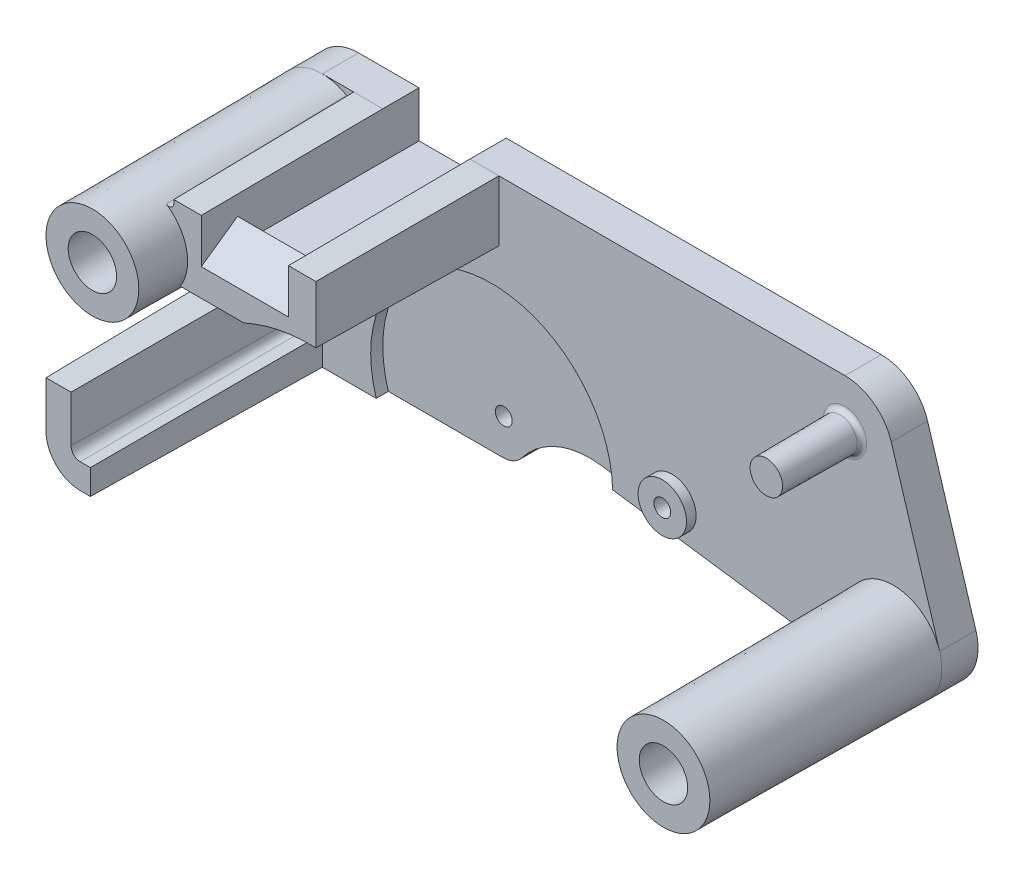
ISO-10303-21;
HEADER;
FILE_DESCRIPTION(('STEP AP214'),'2;1');
FILE_NAME('part.step','',(''),(''),'','','');
FILE_SCHEMA(('AUTOMOTIVE_DESIGN { 1 0 10303 214 1 1 1 1 }'));
ENDSEC;
DATA;
#1=APPLICATION_CONTEXT('core data for automotive mechanical design processes');
#2=APPLICATION_PROTOCOL_DEFINITION('international standard','automotive_design',2000,#1);
#3=PRODUCT_CONTEXT('',#1,'mechanical');
#4=PRODUCT('Part','Part','',(#3));
#5=PRODUCT_RELATED_PRODUCT_CATEGORY('part','',(#4));
#6=PRODUCT_DEFINITION_FORMATION('','',#4);
#7=PRODUCT_DEFINITION_CONTEXT('part definition',#1,'design');
#8=PRODUCT_DEFINITION('design','',#6,#7);
#9=PRODUCT_DEFINITION_SHAPE('','',#8);
#10=(LENGTH_UNIT() NAMED_UNIT(*) SI_UNIT(.MILLI.,.METRE.));
#11=(NAMED_UNIT(*) PLANE_ANGLE_UNIT() SI_UNIT($,.RADIAN.));
#12=(NAMED_UNIT(*) SI_UNIT($,.STERADIAN.) SOLID_ANGLE_UNIT());
#13=UNCERTAINTY_MEASURE_WITH_UNIT(LENGTH_MEASURE(1.E-05),#10,'distance_accuracy_value','');
#14=(GEOMETRIC_REPRESENTATION_CONTEXT(3) GLOBAL_UNCERTAINTY_ASSIGNED_CONTEXT((#13)) GLOBAL_UNIT_ASSIGNED_CONTEXT((#10,
#11,#12)) REPRESENTATION_CONTEXT('',''));
#15=CARTESIAN_POINT('',(0.,0.,0.));
#16=DIRECTION('',(0.,0.,1.));
#17=DIRECTION('',(1.,0.,0.));
#18=AXIS2_PLACEMENT_3D('',#15,#16,#17);
#19=CARTESIAN_POINT('',(6.0237424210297,0.157196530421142,1.47278062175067));
#20=DIRECTION('',(1.,0.,0.));
#21=DIRECTION('',(0.,0.,-1.));
#22=AXIS2_PLACEMENT_3D('',#19,#20,#21);
#23=PLANE('',#22);
#24=DIRECTION('',(0.,-0.57357643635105,0.819152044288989));
#25=VECTOR('',#24,1.);
#26=CARTESIAN_POINT('',(6.0237424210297,1.22693859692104,7.58378062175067));
#27=LINE('',#26,#25);
#28=CARTESIAN_POINT('',(6.0237424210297,1.22693859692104,7.58378062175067));
#29=VERTEX_POINT('',#28);
#30=CARTESIAN_POINT('',(6.0237424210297,0.157196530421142,9.11153062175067));
#31=VERTEX_POINT('',#30);
#32=EDGE_CURVE('E267',#29,#31,#27,.T.);
#33=ORIENTED_EDGE('',*,*,#32,.T.);
#34=DIRECTION('',(0.,-1.,0.));
#35=VECTOR('',#34,1.);
#36=CARTESIAN_POINT('',(6.0237424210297,2.09234653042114,9.11153062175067));
#37=LINE('',#36,#35);
#38=CARTESIAN_POINT('',(6.02374242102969,2.02568416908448,9.11153062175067));
#39=VERTEX_POINT('',#38);
#40=EDGE_CURVE('E738',#39,#31,#37,.T.);
#41=ORIENTED_EDGE('',*,*,#40,.F.);
#42=DIRECTION('',(0.,0.00872653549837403,-0.999961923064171));
#43=VECTOR('',#42,1.);
#44=CARTESIAN_POINT('',(6.0237424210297,2.09219916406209,1.48966713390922));
#45=LINE('',#44,#43);
#46=CARTESIAN_POINT('',(6.0237424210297,2.09234653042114,1.47278062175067));
#47=VERTEX_POINT('',#46);
#48=EDGE_CURVE('E748',#39,#47,#45,.T.);
#49=ORIENTED_EDGE('',*,*,#48,.T.);
#50=DIRECTION('',(0.,0.,-1.));
#51=VECTOR('',#50,1.);
#52=CARTESIAN_POINT('',(6.0237424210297,2.09234653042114,1.47278062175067));
#53=LINE('',#52,#51);
#54=CARTESIAN_POINT('',(6.0237424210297,2.09234653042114,-0.0549693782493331));
#55=VERTEX_POINT('',#54);
#56=EDGE_CURVE('E282',#47,#55,#53,.T.);
#57=ORIENTED_EDGE('',*,*,#56,.T.);
#58=DIRECTION('',(0.,-1.,0.));
#59=VECTOR('',#58,1.);
#60=CARTESIAN_POINT('',(6.0237424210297,0.157196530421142,-0.0549693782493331));
#61=LINE('',#60,#59);
#62=CARTESIAN_POINT('',(6.0237424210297,0.157196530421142,-0.0549693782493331));
#63=VERTEX_POINT('',#62);
#64=EDGE_CURVE('E280',#55,#63,#61,.T.);
#65=ORIENTED_EDGE('',*,*,#64,.T.);
#66=DIRECTION('',(0.,0.,-1.));
#67=VECTOR('',#66,1.);
#68=CARTESIAN_POINT('',(6.0237424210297,0.157196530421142,1.47278062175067));
#69=LINE('',#68,#67);
#70=CARTESIAN_POINT('',(6.0237424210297,0.157196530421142,7.58378062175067));
#71=VERTEX_POINT('',#70);
#72=EDGE_CURVE('E274',#71,#63,#69,.T.);
#73=ORIENTED_EDGE('',*,*,#72,.F.);
#74=DIRECTION('',(0.,1.,0.));
#75=VECTOR('',#74,1.);
#76=CARTESIAN_POINT('',(6.0237424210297,0.157196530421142,7.58378062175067));
#77=LINE('',#76,#75);
#78=EDGE_CURVE('E256',#71,#29,#77,.T.);
#79=ORIENTED_EDGE('',*,*,#78,.T.);
#80=EDGE_LOOP('',(#33,#41,#49,#57,#65,#73,#79));
#81=FACE_BOUND('',#80,.T.);
#82=ADVANCED_FACE('F33',(#81),#23,.F.);
#83=CARTESIAN_POINT('',(2.3571424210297,0.157196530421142,1.47278062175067));
#84=DIRECTION('',(0.,-1.,0.));
#85=DIRECTION('',(0.,0.,-1.));
#86=AXIS2_PLACEMENT_3D('',#83,#84,#85);
#87=PLANE('',#86);
#88=DIRECTION('',(-1.,0.,0.));
#89=VECTOR('',#88,1.);
#90=CARTESIAN_POINT('',(7.88878079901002,0.157196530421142,7.58378062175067));
#91=LINE('',#90,#89);
#92=CARTESIAN_POINT('',(2.3571424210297,0.157196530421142,7.58378062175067));
#93=VERTEX_POINT('',#92);
#94=EDGE_CURVE('E260',#71,#93,#91,.T.);
#95=ORIENTED_EDGE('',*,*,#94,.F.);
#96=ORIENTED_EDGE('',*,*,#72,.T.);
#97=DIRECTION('',(-1.,0.,0.));
#98=VECTOR('',#97,1.);
#99=CARTESIAN_POINT('',(2.3571424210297,0.157196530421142,-0.0549693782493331));
#100=LINE('',#99,#98);
#101=CARTESIAN_POINT('',(2.3571424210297,0.157196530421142,-0.0549693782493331));
#102=VERTEX_POINT('',#101);
#103=EDGE_CURVE('E483',#63,#102,#100,.T.);
#104=ORIENTED_EDGE('',*,*,#103,.T.);
#105=DIRECTION('',(0.,0.,-1.));
#106=VECTOR('',#105,1.);
#107=CARTESIAN_POINT('',(2.3571424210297,0.157196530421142,1.47278062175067));
#108=LINE('',#107,#106);
#109=EDGE_CURVE('E276',#93,#102,#108,.T.);
#110=ORIENTED_EDGE('',*,*,#109,.F.);
#111=EDGE_LOOP('',(#95,#96,#104,#110));
#112=FACE_BOUND('',#111,.T.);
#113=ADVANCED_FACE('F272',(#112),#87,.F.);
#114=CARTESIAN_POINT('',(2.3571424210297,2.09234653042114,1.47278062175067));
#115=DIRECTION('',(-1.,0.,0.));
#116=DIRECTION('',(0.,0.,1.));
#117=AXIS2_PLACEMENT_3D('',#114,#115,#116);
#118=PLANE('',#117);
#119=DIRECTION('',(0.,-0.57357643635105,0.819152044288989));
#120=VECTOR('',#119,1.);
#121=CARTESIAN_POINT('',(2.3571424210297,1.22693859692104,7.58378062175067));
#122=LINE('',#121,#120);
#123=CARTESIAN_POINT('',(2.3571424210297,1.22693859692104,7.58378062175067));
#124=VERTEX_POINT('',#123);
#125=CARTESIAN_POINT('',(2.3571424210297,0.157196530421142,9.11153062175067));
#126=VERTEX_POINT('',#125);
#127=EDGE_CURVE('E277',#124,#126,#122,.T.);
#128=ORIENTED_EDGE('',*,*,#127,.F.);
#129=DIRECTION('',(0.,1.,0.));
#130=VECTOR('',#129,1.);
#131=CARTESIAN_POINT('',(2.3571424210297,0.157196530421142,7.58378062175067));
#132=LINE('',#131,#130);
#133=EDGE_CURVE('E268',#93,#124,#132,.T.);
#134=ORIENTED_EDGE('',*,*,#133,.F.);
#135=ORIENTED_EDGE('',*,*,#109,.T.);
#136=DIRECTION('',(0.,1.,0.));
#137=VECTOR('',#136,1.);
#138=CARTESIAN_POINT('',(2.3571424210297,2.09234653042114,-0.0549693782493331));
#139=LINE('',#138,#137);
#140=CARTESIAN_POINT('',(2.3571424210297,2.09234653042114,-0.0549693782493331));
#141=VERTEX_POINT('',#140);
#142=EDGE_CURVE('E485',#102,#141,#139,.T.);
#143=ORIENTED_EDGE('',*,*,#142,.T.);
#144=DIRECTION('',(0.,0.,-1.));
#145=VECTOR('',#144,1.);
#146=CARTESIAN_POINT('',(2.3571424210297,2.09234653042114,1.47278062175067));
#147=LINE('',#146,#145);
#148=CARTESIAN_POINT('',(2.3571424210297,2.09234653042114,1.47278062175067));
#149=VERTEX_POINT('',#148);
#150=EDGE_CURVE('E286',#149,#141,#147,.T.);
#151=ORIENTED_EDGE('',*,*,#150,.F.);
#152=DIRECTION('',(0.,-0.00872653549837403,0.999961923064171));
#153=VECTOR('',#152,1.);
#154=CARTESIAN_POINT('',(2.3571424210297,2.09234653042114,1.47278062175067));
#155=LINE('',#154,#153);
#156=CARTESIAN_POINT('',(2.3571424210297,2.02568416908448,9.11153062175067));
#157=VERTEX_POINT('',#156);
#158=EDGE_CURVE('E752',#149,#157,#155,.T.);
#159=ORIENTED_EDGE('',*,*,#158,.T.);
#160=DIRECTION('',(0.,1.,0.));
#161=VECTOR('',#160,1.);
#162=CARTESIAN_POINT('',(2.3571424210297,0.157196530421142,9.11153062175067));
#163=LINE('',#162,#161);
#164=EDGE_CURVE('E744',#126,#157,#163,.T.);
#165=ORIENTED_EDGE('',*,*,#164,.F.);
#166=EDGE_LOOP('',(#128,#134,#135,#143,#151,#159,#165));
#167=FACE_BOUND('',#166,.T.);
#168=ADVANCED_FACE('F444',(#167),#118,.F.);
#169=CARTESIAN_POINT('',(21.8104924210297,0.0553465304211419,1.47278062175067));
#170=DIRECTION('',(0.,0.,1.));
#171=DIRECTION('',(1.,0.,0.));
#172=AXIS2_PLACEMENT_3D('',#169,#170,#171);
#173=PLANE('',#172);
#174=CARTESIAN_POINT('',(-0.189107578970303,0.0553465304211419,1.47278062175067));
#175=DIRECTION('',(0.,0.,1.));
#176=DIRECTION('',(1.,0.,0.));
#177=AXIS2_PLACEMENT_3D('',#174,#175,#176);
#178=CIRCLE('',#177,2.037);
#179=CARTESIAN_POINT('',(0.829402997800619,1.81943417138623,1.47278062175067));
#180=VERTEX_POINT('',#179);
#181=CARTESIAN_POINT('',(-0.189107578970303,2.09234653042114,1.47278062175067));
#182=VERTEX_POINT('',#181);
#183=EDGE_CURVE('E718',#180,#182,#178,.T.);
#184=ORIENTED_EDGE('',*,*,#183,.F.);
#185=CARTESIAN_POINT('',(1.12938853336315,2.00543217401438,0.836368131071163));
#186=CARTESIAN_POINT('',(1.12937313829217,1.88813793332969,0.834604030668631));
#187=CARTESIAN_POINT('',(1.02790735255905,1.82926735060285,0.834604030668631));
#188=CARTESIAN_POINT('',(0.926441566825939,1.77039676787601,0.834604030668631));
#189=CARTESIAN_POINT('',(0.824604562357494,1.82859611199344,0.836368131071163));
#190=CARTESIAN_POINT('',(1.13575511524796,1.99445899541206,1.56590615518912));
#191=CARTESIAN_POINT('',(1.13574405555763,1.87682580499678,1.56463884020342));
#192=CARTESIAN_POINT('',(1.03384350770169,1.81804474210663,1.56412714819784));
#193=CARTESIAN_POINT('',(0.931951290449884,1.75924798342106,1.56463884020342));
#194=CARTESIAN_POINT('',(0.830107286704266,1.81811679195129,1.5659061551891));
#195=CARTESIAN_POINT('',(1.14212168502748,1.98339347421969,2.29544279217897));
#196=CARTESIAN_POINT('',(1.14211065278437,1.86542390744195,2.29417862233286));
#197=CARTESIAN_POINT('',(1.0397732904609,1.80672820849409,2.29364847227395));
#198=CARTESIAN_POINT('',(0.937444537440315,1.74801592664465,2.29417862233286));
#199=CARTESIAN_POINT('',(0.835602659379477,1.80755768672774,2.29544279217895));
#200=CARTESIAN_POINT('',(1.15485479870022,1.96106737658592,3.75451309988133));
#201=CARTESIAN_POINT('',(1.15484350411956,1.84241556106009,3.75321886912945));
#202=CARTESIAN_POINT('',(1.05161937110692,1.7838968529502,3.75268725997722));
#203=CARTESIAN_POINT('',(0.948403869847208,1.72536149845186,3.75321886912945));
#204=CARTESIAN_POINT('',(0.846578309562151,1.7862711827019,3.75451309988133));
#205=CARTESIAN_POINT('',(1.16122134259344,1.94980680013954,4.48404677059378));
#206=CARTESIAN_POINT('',(1.16121005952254,1.83080826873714,4.48275385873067));
#207=CARTESIAN_POINT('',(1.05753566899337,1.77238203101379,4.48220472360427));
#208=CARTESIAN_POINT('',(0.953870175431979,1.71393831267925,4.48275385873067));
#209=CARTESIAN_POINT('',(0.85205858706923,1.77554378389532,4.48404677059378));
#210=CARTESIAN_POINT('',(1.17395440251,1.92708022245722,5.94311091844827));
#211=CARTESIAN_POINT('',(1.17394284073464,1.80737809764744,5.94178607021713));
#212=CARTESIAN_POINT('',(1.06935403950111,1.7491436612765,5.94123548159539));
#213=CARTESIAN_POINT('',(0.964774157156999,1.69089167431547,5.94178607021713));
#214=CARTESIAN_POINT('',(0.863003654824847,1.75391196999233,5.94311091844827));
#215=CARTESIAN_POINT('',(1.18032091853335,1.91561422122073,6.67264139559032));
#216=CARTESIAN_POINT('',(1.18030938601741,1.79555430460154,6.67131990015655));
#217=CARTESIAN_POINT('',(1.07525611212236,1.73742011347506,6.67074877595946));
#218=CARTESIAN_POINT('',(0.970212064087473,1.6792673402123,6.67131990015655));
#219=CARTESIAN_POINT('',(0.868468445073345,1.74300755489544,6.6726413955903));
#220=CARTESIAN_POINT('',(1.19305392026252,1.89246449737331,8.13169887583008));
#221=CARTESIAN_POINT('',(1.19304205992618,1.77167844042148,8.13033981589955));
#222=CARTESIAN_POINT('',(1.0870451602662,1.7137519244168,8.12977081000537));
#223=CARTESIAN_POINT('',(0.981057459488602,1.65580700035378,8.13033981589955));
#224=CARTESIAN_POINT('',(0.879382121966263,1.72101135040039,8.13169887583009));
#225=CARTESIAN_POINT('',(1.19942040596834,1.88078077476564,8.86122587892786));
#226=CARTESIAN_POINT('',(1.1994085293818,1.7596253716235,8.85986495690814));
#227=CARTESIAN_POINT('',(1.09293213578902,1.70180728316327,8.85927954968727));
#228=CARTESIAN_POINT('',(0.986465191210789,1.64397003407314,8.85986495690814));
#229=CARTESIAN_POINT('',(0.884831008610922,1.70991956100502,8.86122587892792));
#230=CARTESIAN_POINT('',(1.22402025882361,1.83519396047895,11.6800898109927));
#231=CARTESIAN_POINT('',(1.22404521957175,1.71251703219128,11.6829500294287));
#232=CARTESIAN_POINT('',(1.11564859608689,1.65520563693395,11.6780706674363));
#233=CARTESIAN_POINT('',(1.0073305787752,1.59773234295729,11.6829500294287));
#234=CARTESIAN_POINT('',(0.905853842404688,1.66668187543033,11.6800898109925));
#235=CARTESIAN_POINT('',(1.24225351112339,1.80046838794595,13.7694135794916));
#236=CARTESIAN_POINT('',(1.24228319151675,1.67664999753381,13.7728146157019));
#237=CARTESIAN_POINT('',(1.13242096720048,1.6197137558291,13.7673357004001));
#238=CARTESIAN_POINT('',(1.02264614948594,1.5625831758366,13.7728146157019));
#239=CARTESIAN_POINT('',(0.921369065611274,1.63382890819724,13.7694135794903));
#240=CARTESIAN_POINT('',(1.27871968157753,1.72875051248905,17.948022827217));
#241=CARTESIAN_POINT('',(1.27874736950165,1.60256200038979,17.9511955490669));
#242=CARTESIAN_POINT('',(1.16580806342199,1.54643322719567,17.9458141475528));
#243=CARTESIAN_POINT('',(1.05295490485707,1.4901178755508,17.9511955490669));
#244=CARTESIAN_POINT('',(0.952254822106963,1.56618032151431,17.9480228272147));
#245=CARTESIAN_POINT('',(1.29695259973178,1.69175820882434,20.0373083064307));
#246=CARTESIAN_POINT('',(1.29698399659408,1.56430743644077,20.0409060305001));
#247=CARTESIAN_POINT('',(1.18242278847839,1.50864457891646,20.0350275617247));
#248=CARTESIAN_POINT('',(1.06795511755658,1.45276958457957,20.0409060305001));
#249=CARTESIAN_POINT('',(0.967625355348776,1.53138470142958,20.0373083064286));
#250=CARTESIAN_POINT('',(1.31518530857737,1.65343586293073,22.1265698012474));
#251=CARTESIAN_POINT('',(1.31516470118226,1.52476937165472,22.1242084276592));
#252=CARTESIAN_POINT('',(1.19894490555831,1.46950996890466,22.1242084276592));
#253=CARTESIAN_POINT('',(1.08272510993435,1.4142505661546,22.1242084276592));
#254=CARTESIAN_POINT('',(0.98291807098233,1.4954516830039,22.1265698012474));
#255=(BOUNDED_SURFACE() B_SPLINE_SURFACE(3,2,((#185,#186,#187,#188,#189),(#190,#191,#192,#193,
#194),(#195,#196,#197,#198,#199),(#200,#201,#202,#203,#204),(#205,#206,#207,#208,#209),(#210,
#211,#212,#213,#214),(#215,#216,#217,#218,#219),(#220,#221,#222,#223,#224),(#225,#226,#227,#228,
#229),(#230,#231,#232,#233,#234),(#235,#236,#237,#238,#239),(#240,#241,#242,#243,#244),(#245,
#246,#247,#248,#249),(#250,#251,#252,#253,#254)),.UNSPECIFIED.,.F.,.F.,
.F.) B_SPLINE_SURFACE_WITH_KNOTS((4,2,2,2,2,2,4),(3,2,3),(0.,2.18894495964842,4.37788997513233,
6.56683499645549,8.75577998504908,15.0248543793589,21.2939308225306),(0.,0.5,1.),
.UNSPECIFIED.) GEOMETRIC_REPRESENTATION_ITEM() RATIONAL_B_SPLINE_SURFACE(((1.,0.866575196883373,
1.,0.866575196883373,1.),(1.,0.865965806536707,1.,0.865965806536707,1.),(1.,0.86534677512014,1.,
0.86534677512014,1.),(1.,0.864088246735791,1.,0.864088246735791,1.),(1.,0.863448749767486,1.,
0.863448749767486,1.),(1.,0.862148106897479,1.,0.862148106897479,1.),(1.,0.861486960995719,1.,
0.861486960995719,1.),(1.,0.860141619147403,1.,0.860141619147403,1.),(1.,0.859457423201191,1.,
0.859457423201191,1.),(1.,0.856766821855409,1.,0.856766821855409,1.),(1.,0.854673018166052,1.,
0.854673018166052,1.),(1.,0.850241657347,1.,0.850241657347,1.),(1.,0.847904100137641,1.,
0.847904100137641,1.),(1.,0.845422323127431,1.,0.845422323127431,1.))) REPRESENTATION_ITEM('') SURFACE());
#256=CARTESIAN_POINT('',(0.829402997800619,1.81943417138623,1.47278062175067));
#257=CARTESIAN_POINT('',(0.839323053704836,1.81369542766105,1.47278062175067));
#258=CARTESIAN_POINT('',(0.84973356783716,1.80881197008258,1.47278062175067));
#259=CARTESIAN_POINT('',(0.871216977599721,1.80085677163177,1.47278062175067));
#260=CARTESIAN_POINT('',(0.882289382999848,1.79778370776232,1.47278062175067));
#261=CARTESIAN_POINT('',(0.904798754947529,1.79354075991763,1.47278062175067));
#262=CARTESIAN_POINT('',(0.916235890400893,1.79237177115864,1.47278062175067));
#263=CARTESIAN_POINT('',(0.939141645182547,1.79197042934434,1.47278062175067));
#264=CARTESIAN_POINT('',(0.950610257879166,1.7927376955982,1.47278062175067));
#265=CARTESIAN_POINT('',(0.973254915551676,1.79618681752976,1.47278062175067));
#266=CARTESIAN_POINT('',(0.984430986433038,1.79886850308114,1.47278062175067));
#267=CARTESIAN_POINT('',(1.00617596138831,1.80607079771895,1.47278062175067));
#268=CARTESIAN_POINT('',(1.01674476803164,1.81059170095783,1.47278062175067));
#269=CARTESIAN_POINT('',(1.03697205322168,1.82134334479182,1.47278062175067));
#270=CARTESIAN_POINT('',(1.04663063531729,1.82757389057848,1.47278062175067));
#271=CARTESIAN_POINT('',(1.0647632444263,1.84156731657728,1.47278062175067));
#272=CARTESIAN_POINT('',(1.0732374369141,1.84932998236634,1.47278062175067));
#273=CARTESIAN_POINT('',(1.08876120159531,1.86616615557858,1.47278062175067));
#274=CARTESIAN_POINT('',(1.09581101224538,1.87523944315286,1.47278062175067));
#275=CARTESIAN_POINT('',(1.10829048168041,1.89444523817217,1.47278062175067));
#276=CARTESIAN_POINT('',(1.11371941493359,1.90457821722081,1.47278062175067));
#277=CARTESIAN_POINT('',(1.12280301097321,1.92561904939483,1.47278062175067));
#278=CARTESIAN_POINT('',(1.1264562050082,1.93652753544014,1.47278062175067));
#279=CARTESIAN_POINT('',(1.13187135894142,1.95878723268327,1.47278062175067));
#280=CARTESIAN_POINT('',(1.13363696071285,1.97013754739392,1.47278062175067));
#281=CARTESIAN_POINT('',(1.13477575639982,1.98630304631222,1.47278062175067));
#282=CARTESIAN_POINT('',(1.13494358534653,1.99107096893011,1.47278062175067));
#283=CARTESIAN_POINT('',(1.1349424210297,1.99583621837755,1.47278062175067));
#284=B_SPLINE_CURVE_WITH_KNOTS('',3,(#256,#257,#258,#259,#260,#261,#262,#263,#264,#265,#266,
#267,#268,#269,#270,#271,#272,#273,#274,#275,#276,#277,#278,#279,#280,#281,#282,#283),
.UNSPECIFIED.,.F.,.F.,(4,2,2,2,2,2,2,2,2,2,2,2,2,4),(0.,0.0343355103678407,0.0686458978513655,
0.102972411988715,0.137292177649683,0.171608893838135,0.205931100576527,0.240249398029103,
0.274562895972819,0.308870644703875,0.343193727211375,0.377545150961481,0.411830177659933,
0.426130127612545),.UNSPECIFIED.);
#285=CARTESIAN_POINT('',(1.1349424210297,1.99583621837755,1.47278062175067));
#286=VERTEX_POINT('',#285);
#287=EDGE_CURVE('E46',#180,#286,#284,.T.);
#288=ORIENTED_EDGE('',*,*,#287,.T.);
#289=DIRECTION('',(0.,1.,0.));
#290=VECTOR('',#289,1.);
#291=CARTESIAN_POINT('',(1.1349424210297,0.0553465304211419,1.47278062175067));
#292=LINE('',#291,#290);
#293=CARTESIAN_POINT('',(1.1349424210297,2.09234653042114,1.47278062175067));
#294=VERTEX_POINT('',#293);
#295=EDGE_CURVE('E751',#294,#286,#292,.F.);
#296=ORIENTED_EDGE('',*,*,#295,.F.);
#297=DIRECTION('',(-1.,0.,0.));
#298=VECTOR('',#297,1.);
#299=CARTESIAN_POINT('',(-0.189107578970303,2.09234653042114,1.47278062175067));
#300=LINE('',#299,#298);
#301=EDGE_CURVE('E322',#294,#182,#300,.T.);
#302=ORIENTED_EDGE('',*,*,#301,.T.);
#303=EDGE_LOOP('',(#184,#288,#296,#302));
#304=FACE_BOUND('',#303,.T.);
#305=ADVANCED_FACE('F884',(#304),#173,.T.);
#306=CARTESIAN_POINT('',(21.8104924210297,0.0553465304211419,1.47278062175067));
#307=DIRECTION('',(0.,0.,1.));
#308=DIRECTION('',(1.,0.,0.));
#309=AXIS2_PLACEMENT_3D('',#306,#307,#308);
#310=CIRCLE('',#309,0.914880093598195);
#311=CARTESIAN_POINT('',(22.7253725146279,0.0553465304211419,1.47278062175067));
#312=VERTEX_POINT('',#311);
#313=EDGE_CURVE('E295',#312,#312,#310,.F.);
#314=ORIENTED_EDGE('',*,*,#313,.T.);
#315=EDGE_LOOP('',(#314));
#316=FACE_BOUND('',#315,.T.);
#317=CARTESIAN_POINT('',(14.5282174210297,-6.15750346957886,1.47278062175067));
#318=DIRECTION('',(0.,0.,1.));
#319=DIRECTION('',(1.,0.,0.));
#320=AXIS2_PLACEMENT_3D('',#317,#318,#319);
#321=CIRCLE('',#320,1.01850000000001);
#322=CARTESIAN_POINT('',(15.5467174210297,-6.15750346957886,1.47278062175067));
#323=VERTEX_POINT('',#322);
#324=EDGE_CURVE('E663',#323,#323,#321,.T.);
#325=ORIENTED_EDGE('',*,*,#324,.F.);
#326=EDGE_LOOP('',(#325));
#327=FACE_BOUND('',#326,.T.);
#328=CARTESIAN_POINT('',(6.9403924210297,-7.07415346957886,1.47278062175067));
#329=DIRECTION('',(0.,0.,-1.));
#330=DIRECTION('',(1.,0.,0.));
#331=AXIS2_PLACEMENT_3D('',#328,#329,#330);
#332=CIRCLE('',#331,6.62025);
#333=CARTESIAN_POINT('',(4.16229480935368,-1.06500346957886,1.47278062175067));
#334=VERTEX_POINT('',#333);
#335=CARTESIAN_POINT('',(7.2459424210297,-0.460958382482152,1.47278062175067));
#336=VERTEX_POINT('',#335);
#337=EDGE_CURVE('E314',#334,#336,#332,.T.);
#338=ORIENTED_EDGE('',*,*,#337,.F.);
#339=DIRECTION('',(-1.,0.,0.));
#340=VECTOR('',#339,1.);
#341=CARTESIAN_POINT('',(21.8104924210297,-1.06500346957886,1.47278062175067));
#342=LINE('',#341,#340);
#343=CARTESIAN_POINT('',(1.51212282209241,-1.06500346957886,1.47278062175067));
#344=VERTEX_POINT('',#343);
#345=EDGE_CURVE('E366',#344,#334,#342,.F.);
#346=ORIENTED_EDGE('',*,*,#345,.F.);
#347=CARTESIAN_POINT('',(-2.2261075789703,0.0553465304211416,1.47278062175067));
#348=VERTEX_POINT('',#347);
#349=EDGE_CURVE('E588',#348,#344,#178,.T.);
#350=ORIENTED_EDGE('',*,*,#349,.F.);
#351=DIRECTION('',(0.,-1.,0.));
#352=VECTOR('',#351,1.);
#353=CARTESIAN_POINT('',(-2.2261075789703,0.0553465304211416,1.47278062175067));
#354=LINE('',#353,#352);
#355=CARTESIAN_POINT('',(-2.2261075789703,-5.03715346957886,1.47278062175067));
#356=VERTEX_POINT('',#355);
#357=EDGE_CURVE('E515',#348,#356,#354,.T.);
#358=ORIENTED_EDGE('',*,*,#357,.T.);
#359=DIRECTION('',(-1.,0.,0.));
#360=VECTOR('',#359,1.);
#361=CARTESIAN_POINT('',(-1.0039075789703,-5.03715346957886,1.47278062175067));
#362=LINE('',#361,#360);
#363=CARTESIAN_POINT('',(-1.0039075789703,-5.03715346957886,1.47278062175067));
#364=VERTEX_POINT('',#363);
#365=EDGE_CURVE('E584',#364,#356,#362,.T.);
#366=ORIENTED_EDGE('',*,*,#365,.F.);
#367=DIRECTION('',(0.,1.,0.));
#368=VECTOR('',#367,1.);
#369=CARTESIAN_POINT('',(-1.0039075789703,-5.03715346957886,1.47278062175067));
#370=LINE('',#369,#368);
#371=CARTESIAN_POINT('',(-1.0039075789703,-7.07415346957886,1.47278062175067));
#372=VERTEX_POINT('',#371);
#373=EDGE_CURVE('E622',#372,#364,#370,.T.);
#374=ORIENTED_EDGE('',*,*,#373,.F.);
#375=CARTESIAN_POINT('',(-0.698357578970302,-7.07415346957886,1.47278062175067));
#376=DIRECTION('',(0.,0.,-1.));
#377=DIRECTION('',(1.,0.,0.));
#378=AXIS2_PLACEMENT_3D('',#375,#376,#377);
#379=CIRCLE('',#378,0.305549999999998);
#380=CARTESIAN_POINT('',(-0.698357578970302,-7.37970346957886,1.47278062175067));
#381=VERTEX_POINT('',#380);
#382=EDGE_CURVE('E619',#381,#372,#379,.T.);
#383=ORIENTED_EDGE('',*,*,#382,.F.);
#384=DIRECTION('',(-1.,0.,0.));
#385=VECTOR('',#384,1.);
#386=CARTESIAN_POINT('',(-0.698357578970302,-7.37970346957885,1.47278062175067));
#387=LINE('',#386,#385);
#388=CARTESIAN_POINT('',(-0.189107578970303,-7.37970346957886,1.47278062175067));
#389=VERTEX_POINT('',#388);
#390=EDGE_CURVE('E616',#389,#381,#387,.T.);
#391=ORIENTED_EDGE('',*,*,#390,.F.);
#392=DIRECTION('',(0.,1.,0.));
#393=VECTOR('',#392,1.);
#394=CARTESIAN_POINT('',(-0.189107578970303,-7.37970346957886,1.47278062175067));
#395=LINE('',#394,#393);
#396=CARTESIAN_POINT('',(-0.189107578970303,-8.60190346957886,1.47278062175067));
#397=VERTEX_POINT('',#396);
#398=EDGE_CURVE('E607',#397,#389,#395,.T.);
#399=ORIENTED_EDGE('',*,*,#398,.F.);
#400=DIRECTION('',(1.,0.,0.));
#401=VECTOR('',#400,1.);
#402=CARTESIAN_POINT('',(-0.698357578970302,-8.60190346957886,1.47278062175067));
#403=LINE('',#402,#401);
#404=CARTESIAN_POINT('',(2.0824570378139,-8.60190346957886,1.47278062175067));
#405=VERTEX_POINT('',#404);
#406=EDGE_CURVE('E521',#397,#405,#403,.T.);
#407=ORIENTED_EDGE('',*,*,#406,.T.);
#408=CARTESIAN_POINT('',(6.9403924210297,-7.07415346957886,1.47278062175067));
#409=DIRECTION('',(0.,0.,1.));
#410=DIRECTION('',(1.,0.,0.));
#411=AXIS2_PLACEMENT_3D('',#408,#409,#410);
#412=CIRCLE('',#411,5.0925);
#413=CARTESIAN_POINT('',(12.0316420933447,-6.96131276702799,1.47278062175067));
#414=VERTEX_POINT('',#413);
#415=EDGE_CURVE('E675',#414,#405,#412,.T.);
#416=ORIENTED_EDGE('',*,*,#415,.F.);
#417=DIRECTION('',(0.990268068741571,-0.139173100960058,0.));
#418=VECTOR('',#417,1.);
#419=CARTESIAN_POINT('',(23.5639968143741,-8.58207952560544,1.47278062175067));
#420=LINE('',#419,#418);
#421=CARTESIAN_POINT('',(23.5639968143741,-8.58207952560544,1.47278062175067));
#422=VERTEX_POINT('',#421);
#423=EDGE_CURVE('E525',#414,#422,#420,.T.);
#424=ORIENTED_EDGE('',*,*,#423,.T.);
#425=CARTESIAN_POINT('',(23.8474924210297,-6.56490346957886,1.47278062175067));
#426=DIRECTION('',(0.,0.,1.));
#427=DIRECTION('',(1.,0.,0.));
#428=AXIS2_PLACEMENT_3D('',#425,#426,#427);
#429=CIRCLE('',#428,2.037);
#430=CARTESIAN_POINT('',(25.7944142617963,-5.96585059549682,1.47278062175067));
#431=VERTEX_POINT('',#430);
#432=EDGE_CURVE('E610',#431,#422,#429,.T.);
#433=ORIENTED_EDGE('',*,*,#432,.F.);
#434=DIRECTION('',(-0.294085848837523,0.95577900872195,0.));
#435=VECTOR('',#434,1.);
#436=CARTESIAN_POINT('',(23.7574142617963,0.654399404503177,1.47278062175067));
#437=LINE('',#436,#435);
#438=CARTESIAN_POINT('',(23.7574142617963,0.654399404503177,1.47278062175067));
#439=VERTEX_POINT('',#438);
#440=EDGE_CURVE('E530',#431,#439,#437,.T.);
#441=ORIENTED_EDGE('',*,*,#440,.T.);
#442=CARTESIAN_POINT('',(21.8104924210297,0.0553465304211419,1.47278062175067));
#443=DIRECTION('',(0.,0.,1.));
#444=DIRECTION('',(1.,0.,0.));
#445=AXIS2_PLACEMENT_3D('',#442,#443,#444);
#446=CIRCLE('',#445,2.037);
#447=CARTESIAN_POINT('',(21.8104924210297,2.09234653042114,1.47278062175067));
#448=VERTEX_POINT('',#447);
#449=EDGE_CURVE('E323',#439,#448,#446,.T.);
#450=ORIENTED_EDGE('',*,*,#449,.T.);
#451=DIRECTION('',(-1.,0.,0.));
#452=VECTOR('',#451,1.);
#453=CARTESIAN_POINT('',(6.0237424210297,2.09234653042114,1.47278062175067));
#454=LINE('',#453,#452);
#455=CARTESIAN_POINT('',(7.24594242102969,2.09234653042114,1.47278062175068));
#456=VERTEX_POINT('',#455);
#457=EDGE_CURVE('E319',#448,#456,#454,.T.);
#458=ORIENTED_EDGE('',*,*,#457,.T.);
#459=DIRECTION('',(0.,-1.,0.));
#460=VECTOR('',#459,1.);
#461=CARTESIAN_POINT('',(7.2459424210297,0.0553465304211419,1.47278062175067));
#462=LINE('',#461,#460);
#463=EDGE_CURVE('E335',#336,#456,#462,.F.);
#464=ORIENTED_EDGE('',*,*,#463,.F.);
#465=EDGE_LOOP('',(#338,#346,#350,#358,#366,#374,#383,#391,#399,#407,#416,#424,#433,#441,#450,
#458,#464));
#466=FACE_BOUND('',#465,.T.);
#467=ADVANCED_FACE('F375',(#316,#327,#466),#173,.T.);
#468=CARTESIAN_POINT('',(-0.189107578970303,0.0553465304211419,1.47278062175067));
#469=DIRECTION('',(0.,0.,-1.));
#470=DIRECTION('',(1.,0.,0.));
#471=AXIS2_PLACEMENT_3D('',#468,#469,#470);
#472=CONICAL_SURFACE('',#471,2.037,0.00872664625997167);
#473=CARTESIAN_POINT('',(-0.189107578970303,0.0553465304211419,9.11153062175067));
#474=DIRECTION('',(0.,0.,1.));
#475=DIRECTION('',(1.,0.,0.));
#476=AXIS2_PLACEMENT_3D('',#473,#474,#475);
#477=CIRCLE('',#476,1.97033763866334);
#478=CARTESIAN_POINT('',(1.47581667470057,-0.9983411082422,9.11153062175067));
#479=VERTEX_POINT('',#478);
#480=CARTESIAN_POINT('',(0.886696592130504,1.70606631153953,9.11153062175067));
#481=VERTEX_POINT('',#480);
#482=EDGE_CURVE('E53',#479,#481,#477,.T.);
#483=ORIENTED_EDGE('',*,*,#482,.T.);
#484=CARTESIAN_POINT('',(0.98291807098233,1.4954516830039,22.1265698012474));
#485=CARTESIAN_POINT('',(0.967625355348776,1.53138470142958,20.0373083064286));
#486=CARTESIAN_POINT('',(0.952254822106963,1.56618032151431,17.9480228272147));
#487=CARTESIAN_POINT('',(0.921369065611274,1.63382890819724,13.7694135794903));
#488=CARTESIAN_POINT('',(0.905853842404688,1.66668187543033,11.6800898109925));
#489=CARTESIAN_POINT('',(0.884831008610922,1.70991956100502,8.86122587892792));
#490=CARTESIAN_POINT('',(0.879382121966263,1.72101135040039,8.13169887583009));
#491=CARTESIAN_POINT('',(0.868468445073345,1.74300755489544,6.6726413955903));
#492=CARTESIAN_POINT('',(0.863003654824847,1.75391196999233,5.94311091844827));
#493=CARTESIAN_POINT('',(0.85205858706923,1.77554378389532,4.48404677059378));
#494=CARTESIAN_POINT('',(0.846578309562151,1.7862711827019,3.75451309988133));
#495=CARTESIAN_POINT('',(0.835602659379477,1.80755768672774,2.29544279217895));
#496=CARTESIAN_POINT('',(0.830107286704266,1.81811679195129,1.5659061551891));
#497=CARTESIAN_POINT('',(0.824604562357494,1.82859611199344,0.836368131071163));
#498=B_SPLINE_CURVE_WITH_KNOTS('',3,(#484,#485,#486,#487,#488,#489,#490,#491,#492,#493,#494,
#495,#496,#497),.UNSPECIFIED.,.F.,.F.,(4,2,2,2,2,2,4),(0.,6.26907644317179,12.5381508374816,
14.7270958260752,16.9160408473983,19.1049858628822,21.2939308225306),.UNSPECIFIED.);
#499=EDGE_CURVE('E57',#481,#180,#498,.T.);
#500=ORIENTED_EDGE('',*,*,#499,.T.);
#501=ORIENTED_EDGE('',*,*,#183,.T.);
#502=CARTESIAN_POINT('',(-0.189107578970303,0.0553465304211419,1.47278062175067));
#503=DIRECTION('',(0.,0.,1.));
#504=DIRECTION('',(1.,0.,0.));
#505=AXIS2_PLACEMENT_3D('',#502,#503,#504);
#506=CIRCLE('',#505,2.037);
#507=EDGE_CURVE('E328',#182,#348,#506,.T.);
#508=ORIENTED_EDGE('',*,*,#507,.T.);
#509=ORIENTED_EDGE('',*,*,#349,.T.);
#510=CARTESIAN_POINT('',(1.51212282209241,-1.06500346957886,1.47278062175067));
#511=CARTESIAN_POINT('',(1.5057949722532,-1.05325548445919,2.81896637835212));
#512=CARTESIAN_POINT('',(1.49942924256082,-1.04150750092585,4.16515195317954));
#513=CARTESIAN_POINT('',(1.46741119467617,-0.982767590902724,10.8960789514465));
#514=CARTESIAN_POINT('',(1.44119067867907,-0.935775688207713,16.2808176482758));
#515=CARTESIAN_POINT('',(1.41436408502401,-0.888783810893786,21.6655534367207));
#516=B_SPLINE_CURVE_WITH_KNOTS('',3,(#510,#511,#512,#513,#514,#515),.UNSPECIFIED.,.F.,.F.,(4,2,
4),(0.,4.0387556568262,20.1937783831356),.UNSPECIFIED.);
#517=EDGE_CURVE('E325',#479,#344,#516,.F.);
#518=ORIENTED_EDGE('',*,*,#517,.F.);
#519=EDGE_LOOP('',(#483,#500,#501,#508,#509,#518));
#520=FACE_BOUND('',#519,.T.);
#521=CARTESIAN_POINT('',(-0.189107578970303,0.0553465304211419,11.1485306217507));
#522=DIRECTION('',(0.,0.,1.));
#523=DIRECTION('',(1.,0.,0.));
#524=AXIS2_PLACEMENT_3D('',#521,#522,#523);
#525=CIRCLE('',#524,1.95256100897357);
#526=CARTESIAN_POINT('',(1.76345343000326,0.0553465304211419,11.1485306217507));
#527=VERTEX_POINT('',#526);
#528=EDGE_CURVE('E713',#527,#527,#525,.T.);
#529=ORIENTED_EDGE('',*,*,#528,.F.);
#530=EDGE_LOOP('',(#529));
#531=FACE_BOUND('',#530,.T.);
#532=ADVANCED_FACE('F369',(#520,#531),#472,.T.);
#533=CARTESIAN_POINT('',(21.8104924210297,0.0553465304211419,-0.0549693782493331));
#534=DIRECTION('',(0.,0.,1.));
#535=DIRECTION('',(1.,0.,0.));
#536=AXIS2_PLACEMENT_3D('',#533,#534,#535);
#537=PLANE('',#536);
#538=CARTESIAN_POINT('',(6.9403924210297,-7.07415346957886,-0.0549693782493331));
#539=DIRECTION('',(0.,0.,1.));
#540=DIRECTION('',(1.,0.,0.));
#541=AXIS2_PLACEMENT_3D('',#538,#539,#540);
#542=CIRCLE('',#541,1.0185);
#543=CARTESIAN_POINT('',(7.9588924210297,-7.07415346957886,-0.0549693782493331));
#544=VERTEX_POINT('',#543);
#545=EDGE_CURVE('E303',#544,#544,#542,.F.);
#546=ORIENTED_EDGE('',*,*,#545,.F.);
#547=EDGE_LOOP('',(#546));
#548=FACE_BOUND('',#547,.T.);
#549=CARTESIAN_POINT('',(21.8104924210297,0.0553465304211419,-0.0549693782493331));
#550=DIRECTION('',(0.,0.,1.));
#551=DIRECTION('',(1.,0.,0.));
#552=AXIS2_PLACEMENT_3D('',#549,#550,#551);
#553=CIRCLE('',#552,2.037);
#554=CARTESIAN_POINT('',(23.7574142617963,0.654399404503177,-0.0549693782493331));
#555=VERTEX_POINT('',#554);
#556=CARTESIAN_POINT('',(21.8104924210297,2.09234653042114,-0.0549693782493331));
#557=VERTEX_POINT('',#556);
#558=EDGE_CURVE('E466',#555,#557,#553,.T.);
#559=ORIENTED_EDGE('',*,*,#558,.F.);
#560=DIRECTION('',(-0.294085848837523,0.95577900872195,0.));
#561=VECTOR('',#560,1.);
#562=CARTESIAN_POINT('',(23.7574142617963,0.654399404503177,-0.0549693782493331));
#563=LINE('',#562,#561);
#564=CARTESIAN_POINT('',(25.7944142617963,-5.96585059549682,-0.0549693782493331));
#565=VERTEX_POINT('',#564);
#566=EDGE_CURVE('E509',#565,#555,#563,.T.);
#567=ORIENTED_EDGE('',*,*,#566,.F.);
#568=CARTESIAN_POINT('',(23.8474924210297,-6.56490346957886,-0.0549693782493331));
#569=DIRECTION('',(0.,0.,1.));
#570=DIRECTION('',(1.,0.,0.));
#571=AXIS2_PLACEMENT_3D('',#568,#569,#570);
#572=CIRCLE('',#571,2.037);
#573=CARTESIAN_POINT('',(23.5639968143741,-8.58207952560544,-0.0549693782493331));
#574=VERTEX_POINT('',#573);
#575=EDGE_CURVE('E507',#574,#565,#572,.T.);
#576=ORIENTED_EDGE('',*,*,#575,.F.);
#577=DIRECTION('',(0.990268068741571,-0.139173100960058,0.));
#578=VECTOR('',#577,1.);
#579=CARTESIAN_POINT('',(23.5639968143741,-8.58207952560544,-0.0549693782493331));
#580=LINE('',#579,#578);
#581=CARTESIAN_POINT('',(11.0505013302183,-6.82342242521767,-0.0549693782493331));
#582=VERTEX_POINT('',#581);
#583=EDGE_CURVE('E505',#582,#574,#580,.T.);
#584=ORIENTED_EDGE('',*,*,#583,.F.);
#585=CARTESIAN_POINT('',(10.554384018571,-10.3534805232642,-0.0549693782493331));
#586=DIRECTION('',(0.,0.,-1.));
#587=DIRECTION('',(1.,0.,0.));
#588=AXIS2_PLACEMENT_3D('',#585,#586,#587);
#589=CIRCLE('',#588,3.56475);
#590=CARTESIAN_POINT('',(7.71439221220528,-8.19897614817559,-0.0549693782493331));
#591=VERTEX_POINT('',#590);
#592=EDGE_CURVE('E502',#591,#582,#589,.T.);
#593=ORIENTED_EDGE('',*,*,#592,.F.);
#594=CARTESIAN_POINT('',(6.9029659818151,-7.58340346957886,-0.0549693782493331));
#595=DIRECTION('',(0.,0.,1.));
#596=DIRECTION('',(1.,0.,0.));
#597=AXIS2_PLACEMENT_3D('',#594,#595,#596);
#598=CIRCLE('',#597,1.0185);
#599=CARTESIAN_POINT('',(6.9029659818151,-8.60190346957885,-0.0549693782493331));
#600=VERTEX_POINT('',#599);
#601=EDGE_CURVE('E499',#600,#591,#598,.T.);
#602=ORIENTED_EDGE('',*,*,#601,.F.);
#603=DIRECTION('',(1.,0.,0.));
#604=VECTOR('',#603,1.);
#605=CARTESIAN_POINT('',(-0.698357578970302,-8.60190346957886,-0.0549693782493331));
#606=LINE('',#605,#604);
#607=CARTESIAN_POINT('',(-0.698357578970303,-8.60190346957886,-0.0549693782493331));
#608=VERTEX_POINT('',#607);
#609=EDGE_CURVE('E496',#608,#600,#606,.T.);
#610=ORIENTED_EDGE('',*,*,#609,.F.);
#611=CARTESIAN_POINT('',(-0.698357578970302,-7.07415346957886,-0.0549693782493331));
#612=DIRECTION('',(0.,0.,1.));
#613=DIRECTION('',(1.,0.,0.));
#614=AXIS2_PLACEMENT_3D('',#611,#612,#613);
#615=CIRCLE('',#614,1.52775);
#616=CARTESIAN_POINT('',(-2.2261075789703,-7.07415346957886,-0.0549693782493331));
#617=VERTEX_POINT('',#616);
#618=EDGE_CURVE('E494',#617,#608,#615,.T.);
#619=ORIENTED_EDGE('',*,*,#618,.F.);
#620=DIRECTION('',(0.,-1.,0.));
#621=VECTOR('',#620,1.);
#622=CARTESIAN_POINT('',(-2.2261075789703,0.0553465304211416,-0.0549693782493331));
#623=LINE('',#622,#621);
#624=CARTESIAN_POINT('',(-2.2261075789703,0.0553465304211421,-0.0549693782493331));
#625=VERTEX_POINT('',#624);
#626=EDGE_CURVE('E492',#625,#617,#623,.T.);
#627=ORIENTED_EDGE('',*,*,#626,.F.);
#628=CARTESIAN_POINT('',(-0.189107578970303,0.0553465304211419,-0.0549693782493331));
#629=DIRECTION('',(0.,0.,1.));
#630=DIRECTION('',(1.,0.,0.));
#631=AXIS2_PLACEMENT_3D('',#628,#629,#630);
#632=CIRCLE('',#631,2.037);
#633=CARTESIAN_POINT('',(-0.189107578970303,2.09234653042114,-0.0549693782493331));
#634=VERTEX_POINT('',#633);
#635=EDGE_CURVE('E490',#634,#625,#632,.T.);
#636=ORIENTED_EDGE('',*,*,#635,.F.);
#637=DIRECTION('',(-1.,0.,0.));
#638=VECTOR('',#637,1.);
#639=CARTESIAN_POINT('',(-0.189107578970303,2.09234653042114,-0.0549693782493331));
#640=LINE('',#639,#638);
#641=EDGE_CURVE('E488',#141,#634,#640,.T.);
#642=ORIENTED_EDGE('',*,*,#641,.F.);
#643=ORIENTED_EDGE('',*,*,#142,.F.);
#644=ORIENTED_EDGE('',*,*,#103,.F.);
#645=ORIENTED_EDGE('',*,*,#64,.F.);
#646=DIRECTION('',(-1.,0.,0.));
#647=VECTOR('',#646,1.);
#648=CARTESIAN_POINT('',(6.0237424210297,2.09234653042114,-0.0549693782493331));
#649=LINE('',#648,#647);
#650=EDGE_CURVE('E472',#557,#55,#649,.T.);
#651=ORIENTED_EDGE('',*,*,#650,.F.);
#652=EDGE_LOOP('',(#559,#567,#576,#584,#593,#602,#610,#619,#627,#636,#642,#643,#644,#645,#651));
#653=FACE_BOUND('',#652,.T.);
#654=CARTESIAN_POINT('',(14.5282174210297,-6.15750346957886,-0.0549693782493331));
#655=DIRECTION('',(0.,0.,1.));
#656=DIRECTION('',(1.,0.,0.));
#657=AXIS2_PLACEMENT_3D('',#654,#655,#656);
#658=CIRCLE('',#657,1.0185);
#659=CARTESIAN_POINT('',(15.5467174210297,-6.15750346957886,-0.0549693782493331));
#660=VERTEX_POINT('',#659);
#661=EDGE_CURVE('E306',#660,#660,#658,.F.);
#662=ORIENTED_EDGE('',*,*,#661,.F.);
#663=EDGE_LOOP('',(#662));
#664=FACE_BOUND('',#663,.T.);
#665=ADVANCED_FACE('F374',(#548,#653,#664),#537,.F.);
#666=CARTESIAN_POINT('',(6.9029659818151,-7.58340346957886,1.47278062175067));
#667=DIRECTION('',(0.,0.,-1.));
#668=DIRECTION('',(-1.,0.,0.));
#669=AXIS2_PLACEMENT_3D('',#666,#667,#668);
#670=CYLINDRICAL_SURFACE('',#669,1.0185);
#671=CARTESIAN_POINT('',(6.9029659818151,-7.58340346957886,0.963530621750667));
#672=DIRECTION('',(0.,0.,1.));
#673=DIRECTION('',(1.,0.,0.));
#674=AXIS2_PLACEMENT_3D('',#671,#672,#673);
#675=CIRCLE('',#674,1.0185);
#676=CARTESIAN_POINT('',(6.9029659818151,-8.60190346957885,0.963530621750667));
#677=VERTEX_POINT('',#676);
#678=CARTESIAN_POINT('',(7.71439221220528,-8.19897614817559,0.963530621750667));
#679=VERTEX_POINT('',#678);
#680=EDGE_CURVE('E678',#677,#679,#675,.T.);
#681=ORIENTED_EDGE('',*,*,#680,.F.);
#682=DIRECTION('',(0.,0.,-1.));
#683=VECTOR('',#682,1.);
#684=CARTESIAN_POINT('',(6.9029659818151,-8.60190346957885,1.47278062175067));
#685=LINE('',#684,#683);
#686=EDGE_CURVE('E543',#677,#600,#685,.T.);
#687=ORIENTED_EDGE('',*,*,#686,.T.);
#688=ORIENTED_EDGE('',*,*,#601,.T.);
#689=DIRECTION('',(0.,0.,-1.));
#690=VECTOR('',#689,1.);
#691=CARTESIAN_POINT('',(7.71439221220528,-8.19897614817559,1.47278062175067));
#692=LINE('',#691,#690);
#693=EDGE_CURVE('E541',#679,#591,#692,.T.);
#694=ORIENTED_EDGE('',*,*,#693,.F.);
#695=EDGE_LOOP('',(#681,#687,#688,#694));
#696=FACE_BOUND('',#695,.T.);
#697=ADVANCED_FACE('F459',(#696),#670,.T.);
#698=CARTESIAN_POINT('',(10.554384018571,-10.3534805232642,1.47278062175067));
#699=DIRECTION('',(0.,0.,-1.));
#700=DIRECTION('',(-1.,0.,0.));
#701=AXIS2_PLACEMENT_3D('',#698,#699,#700);
#702=CYLINDRICAL_SURFACE('',#701,3.56475);
#703=CARTESIAN_POINT('',(10.554384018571,-10.3534805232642,0.963530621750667));
#704=DIRECTION('',(0.,0.,-1.));
#705=DIRECTION('',(1.,0.,0.));
#706=AXIS2_PLACEMENT_3D('',#703,#704,#705);
#707=CIRCLE('',#706,3.56475);
#708=CARTESIAN_POINT('',(11.0505013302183,-6.82342242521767,0.963530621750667));
#709=VERTEX_POINT('',#708);
#710=EDGE_CURVE('E680',#679,#709,#707,.T.);
#711=ORIENTED_EDGE('',*,*,#710,.F.);
#712=ORIENTED_EDGE('',*,*,#693,.T.);
#713=ORIENTED_EDGE('',*,*,#592,.T.);
#714=DIRECTION('',(0.,0.,-1.));
#715=VECTOR('',#714,1.);
#716=CARTESIAN_POINT('',(11.0505013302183,-6.82342242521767,1.47278062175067));
#717=LINE('',#716,#715);
#718=EDGE_CURVE('E539',#709,#582,#717,.T.);
#719=ORIENTED_EDGE('',*,*,#718,.F.);
#720=EDGE_LOOP('',(#711,#712,#713,#719));
#721=FACE_BOUND('',#720,.T.);
#722=ADVANCED_FACE('F454',(#721),#702,.F.);
#723=CARTESIAN_POINT('',(21.8104924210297,0.0553465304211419,1.47278062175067));
#724=DIRECTION('',(0.,0.,-1.));
#725=DIRECTION('',(-1.,0.,0.));
#726=AXIS2_PLACEMENT_3D('',#723,#724,#725);
#727=CYLINDRICAL_SURFACE('',#726,2.037);
#728=ORIENTED_EDGE('',*,*,#558,.T.);
#729=DIRECTION('',(0.,0.,-1.));
#730=VECTOR('',#729,1.);
#731=CARTESIAN_POINT('',(21.8104924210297,2.09234653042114,1.47278062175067));
#732=LINE('',#731,#730);
#733=EDGE_CURVE('E284',#448,#557,#732,.T.);
#734=ORIENTED_EDGE('',*,*,#733,.F.);
#735=ORIENTED_EDGE('',*,*,#449,.F.);
#736=DIRECTION('',(0.,0.,-1.));
#737=VECTOR('',#736,1.);
#738=CARTESIAN_POINT('',(23.7574142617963,0.654399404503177,1.47278062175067));
#739=LINE('',#738,#737);
#740=EDGE_CURVE('E469',#439,#555,#739,.T.);
#741=ORIENTED_EDGE('',*,*,#740,.T.);
#742=EDGE_LOOP('',(#728,#734,#735,#741));
#743=FACE_BOUND('',#742,.T.);
#744=ADVANCED_FACE('F451',(#743),#727,.T.);
#745=CARTESIAN_POINT('',(6.0237424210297,2.09234653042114,1.47278062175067));
#746=DIRECTION('',(0.,-1.,0.));
#747=DIRECTION('',(0.,0.,-1.));
#748=AXIS2_PLACEMENT_3D('',#745,#746,#747);
#749=PLANE('',#748);
#750=ORIENTED_EDGE('',*,*,#56,.F.);
#751=DIRECTION('',(1.,0.,0.));
#752=VECTOR('',#751,1.);
#753=CARTESIAN_POINT('',(-2.2261075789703,2.09234653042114,1.47278062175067));
#754=LINE('',#753,#752);
#755=EDGE_CURVE('E759',#47,#456,#754,.T.);
#756=ORIENTED_EDGE('',*,*,#755,.T.);
#757=ORIENTED_EDGE('',*,*,#457,.F.);
#758=ORIENTED_EDGE('',*,*,#733,.T.);
#759=ORIENTED_EDGE('',*,*,#650,.T.);
#760=EDGE_LOOP('',(#750,#756,#757,#758,#759));
#761=FACE_BOUND('',#760,.T.);
#762=ADVANCED_FACE('F448',(#761),#749,.F.);
#763=CARTESIAN_POINT('',(-0.189107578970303,2.09234653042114,1.47278062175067));
#764=DIRECTION('',(0.,-1.,0.));
#765=DIRECTION('',(0.,0.,-1.));
#766=AXIS2_PLACEMENT_3D('',#763,#764,#765);
#767=PLANE('',#766);
#768=ORIENTED_EDGE('',*,*,#301,.F.);
#769=EDGE_CURVE('E562',#294,#149,#754,.T.);
#770=ORIENTED_EDGE('',*,*,#769,.T.);
#771=ORIENTED_EDGE('',*,*,#150,.T.);
#772=ORIENTED_EDGE('',*,*,#641,.T.);
#773=DIRECTION('',(0.,0.,-1.));
#774=VECTOR('',#773,1.);
#775=CARTESIAN_POINT('',(-0.189107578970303,2.09234653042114,1.47278062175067));
#776=LINE('',#775,#774);
#777=EDGE_CURVE('E554',#182,#634,#776,.T.);
#778=ORIENTED_EDGE('',*,*,#777,.F.);
#779=EDGE_LOOP('',(#768,#770,#771,#772,#778));
#780=FACE_BOUND('',#779,.T.);
#781=ADVANCED_FACE('F450',(#780),#767,.F.);
#782=CARTESIAN_POINT('',(-0.189107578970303,0.0553465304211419,1.47278062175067));
#783=DIRECTION('',(0.,0.,-1.));
#784=DIRECTION('',(-1.,0.,0.));
#785=AXIS2_PLACEMENT_3D('',#782,#783,#784);
#786=CYLINDRICAL_SURFACE('',#785,2.037);
#787=ORIENTED_EDGE('',*,*,#635,.T.);
#788=DIRECTION('',(0.,0.,-1.));
#789=VECTOR('',#788,1.);
#790=CARTESIAN_POINT('',(-2.2261075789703,0.0553465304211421,1.47278062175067));
#791=LINE('',#790,#789);
#792=EDGE_CURVE('E551',#348,#625,#791,.T.);
#793=ORIENTED_EDGE('',*,*,#792,.F.);
#794=ORIENTED_EDGE('',*,*,#507,.F.);
#795=ORIENTED_EDGE('',*,*,#777,.T.);
#796=EDGE_LOOP('',(#787,#793,#794,#795));
#797=FACE_BOUND('',#796,.T.);
#798=ADVANCED_FACE('F573',(#797),#786,.T.);
#799=CARTESIAN_POINT('',(-2.2261075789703,0.0553465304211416,1.47278062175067));
#800=DIRECTION('',(1.,0.,0.));
#801=DIRECTION('',(0.,1.,0.));
#802=AXIS2_PLACEMENT_3D('',#799,#800,#801);
#803=PLANE('',#802);
#804=ORIENTED_EDGE('',*,*,#626,.T.);
#805=DIRECTION('',(0.,0.,-1.));
#806=VECTOR('',#805,1.);
#807=CARTESIAN_POINT('',(-2.2261075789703,-7.07415346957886,1.47278062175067));
#808=LINE('',#807,#806);
#809=CARTESIAN_POINT('',(-2.2261075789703,-7.07415346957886,1.47278062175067));
#810=VERTEX_POINT('',#809);
#811=EDGE_CURVE('E548',#810,#617,#808,.T.);
#812=ORIENTED_EDGE('',*,*,#811,.F.);
#813=DIRECTION('',(0.,-1.,0.));
#814=VECTOR('',#813,1.);
#815=CARTESIAN_POINT('',(-2.2261075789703,-5.03715346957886,1.47278062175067));
#816=LINE('',#815,#814);
#817=EDGE_CURVE('E579',#356,#810,#816,.T.);
#818=ORIENTED_EDGE('',*,*,#817,.F.);
#819=ORIENTED_EDGE('',*,*,#357,.F.);
#820=ORIENTED_EDGE('',*,*,#792,.T.);
#821=EDGE_LOOP('',(#804,#812,#818,#819,#820));
#822=FACE_BOUND('',#821,.T.);
#823=ADVANCED_FACE('F577',(#822),#803,.F.);
#824=CARTESIAN_POINT('',(-0.698357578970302,-7.07415346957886,1.47278062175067));
#825=DIRECTION('',(0.,0.,-1.));
#826=DIRECTION('',(-1.,0.,0.));
#827=AXIS2_PLACEMENT_3D('',#824,#825,#826);
#828=CYLINDRICAL_SURFACE('',#827,1.52775);
#829=ORIENTED_EDGE('',*,*,#618,.T.);
#830=DIRECTION('',(0.,0.,-1.));
#831=VECTOR('',#830,1.);
#832=CARTESIAN_POINT('',(-0.698357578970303,-8.60190346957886,1.47278062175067));
#833=LINE('',#832,#831);
#834=CARTESIAN_POINT('',(-0.698357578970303,-8.60190346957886,1.47278062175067));
#835=VERTEX_POINT('',#834);
#836=EDGE_CURVE('E545',#835,#608,#833,.T.);
#837=ORIENTED_EDGE('',*,*,#836,.F.);
#838=CARTESIAN_POINT('',(-0.698357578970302,-7.07415346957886,1.47278062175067));
#839=DIRECTION('',(0.,0.,1.));
#840=DIRECTION('',(1.,0.,0.));
#841=AXIS2_PLACEMENT_3D('',#838,#839,#840);
#842=CIRCLE('',#841,1.52775);
#843=EDGE_CURVE('E518',#810,#835,#842,.T.);
#844=ORIENTED_EDGE('',*,*,#843,.F.);
#845=ORIENTED_EDGE('',*,*,#811,.T.);
#846=EDGE_LOOP('',(#829,#837,#844,#845));
#847=FACE_BOUND('',#846,.T.);
#848=ADVANCED_FACE('F782',(#847),#828,.T.);
#849=CARTESIAN_POINT('',(-0.698357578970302,-8.60190346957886,1.47278062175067));
#850=DIRECTION('',(0.,1.,0.));
#851=DIRECTION('',(-1.,0.,0.));
#852=AXIS2_PLACEMENT_3D('',#849,#850,#851);
#853=PLANE('',#852);
#854=DIRECTION('',(1.,0.,0.));
#855=VECTOR('',#854,1.);
#856=CARTESIAN_POINT('',(2.0824570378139,-8.60190346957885,0.963530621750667));
#857=LINE('',#856,#855);
#858=CARTESIAN_POINT('',(2.0824570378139,-8.60190346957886,0.963530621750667));
#859=VERTEX_POINT('',#858);
#860=EDGE_CURVE('E684',#859,#677,#857,.T.);
#861=ORIENTED_EDGE('',*,*,#860,.F.);
#862=DIRECTION('',(0.,0.,1.));
#863=VECTOR('',#862,1.);
#864=CARTESIAN_POINT('',(2.0824570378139,-8.60190346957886,0.963530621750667));
#865=LINE('',#864,#863);
#866=EDGE_CURVE('E478',#859,#405,#865,.T.);
#867=ORIENTED_EDGE('',*,*,#866,.T.);
#868=ORIENTED_EDGE('',*,*,#406,.F.);
#869=EDGE_CURVE('E522',#835,#397,#403,.T.);
#870=ORIENTED_EDGE('',*,*,#869,.F.);
#871=ORIENTED_EDGE('',*,*,#836,.T.);
#872=ORIENTED_EDGE('',*,*,#609,.T.);
#873=ORIENTED_EDGE('',*,*,#686,.F.);
#874=EDGE_LOOP('',(#861,#867,#868,#870,#871,#872,#873));
#875=FACE_BOUND('',#874,.T.);
#876=ADVANCED_FACE('F689',(#875),#853,.F.);
#877=CARTESIAN_POINT('',(23.5639968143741,-8.58207952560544,1.47278062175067));
#878=DIRECTION('',(0.139173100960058,0.990268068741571,0.));
#879=DIRECTION('',(-0.990268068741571,0.139173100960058,0.));
#880=AXIS2_PLACEMENT_3D('',#877,#878,#879);
#881=PLANE('',#880);
#882=ORIENTED_EDGE('',*,*,#423,.F.);
#883=DIRECTION('',(0.,0.,1.));
#884=VECTOR('',#883,1.);
#885=CARTESIAN_POINT('',(12.0316420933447,-6.96131276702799,0.963530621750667));
#886=LINE('',#885,#884);
#887=CARTESIAN_POINT('',(12.0316420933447,-6.96131276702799,0.963530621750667));
#888=VERTEX_POINT('',#887);
#889=EDGE_CURVE('E300',#414,#888,#886,.F.);
#890=ORIENTED_EDGE('',*,*,#889,.T.);
#891=DIRECTION('',(0.990268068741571,-0.139173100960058,0.));
#892=VECTOR('',#891,1.);
#893=CARTESIAN_POINT('',(23.5639968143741,-8.58207952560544,0.963530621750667));
#894=LINE('',#893,#892);
#895=EDGE_CURVE('E298',#709,#888,#894,.T.);
#896=ORIENTED_EDGE('',*,*,#895,.F.);
#897=ORIENTED_EDGE('',*,*,#718,.T.);
#898=ORIENTED_EDGE('',*,*,#583,.T.);
#899=DIRECTION('',(0.,0.,-1.));
#900=VECTOR('',#899,1.);
#901=CARTESIAN_POINT('',(23.5639968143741,-8.58207952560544,1.47278062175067));
#902=LINE('',#901,#900);
#903=EDGE_CURVE('E536',#422,#574,#902,.T.);
#904=ORIENTED_EDGE('',*,*,#903,.F.);
#905=EDGE_LOOP('',(#882,#890,#896,#897,#898,#904));
#906=FACE_BOUND('',#905,.T.);
#907=ADVANCED_FACE('F701',(#906),#881,.F.);
#908=CARTESIAN_POINT('',(23.8474924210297,-6.56490346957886,1.47278062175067));
#909=DIRECTION('',(0.,0.,-1.));
#910=DIRECTION('',(-1.,0.,0.));
#911=AXIS2_PLACEMENT_3D('',#908,#909,#910);
#912=CYLINDRICAL_SURFACE('',#911,2.037);
#913=ORIENTED_EDGE('',*,*,#575,.T.);
#914=DIRECTION('',(0.,0.,-1.));
#915=VECTOR('',#914,1.);
#916=CARTESIAN_POINT('',(25.7944142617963,-5.96585059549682,1.47278062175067));
#917=LINE('',#916,#915);
#918=EDGE_CURVE('E533',#431,#565,#917,.T.);
#919=ORIENTED_EDGE('',*,*,#918,.F.);
#920=CARTESIAN_POINT('',(23.8474924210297,-6.56490346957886,1.47278062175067));
#921=DIRECTION('',(0.,0.,1.));
#922=DIRECTION('',(1.,0.,0.));
#923=AXIS2_PLACEMENT_3D('',#920,#921,#922);
#924=CIRCLE('',#923,2.037);
#925=EDGE_CURVE('E527',#422,#431,#924,.T.);
#926=ORIENTED_EDGE('',*,*,#925,.F.);
#927=ORIENTED_EDGE('',*,*,#903,.T.);
#928=EDGE_LOOP('',(#913,#919,#926,#927));
#929=FACE_BOUND('',#928,.T.);
#930=ADVANCED_FACE('F709',(#929),#912,.T.);
#931=CARTESIAN_POINT('',(23.7574142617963,0.654399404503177,1.47278062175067));
#932=DIRECTION('',(-0.95577900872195,-0.294085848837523,0.));
#933=DIRECTION('',(0.294085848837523,-0.95577900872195,0.));
#934=AXIS2_PLACEMENT_3D('',#931,#932,#933);
#935=PLANE('',#934);
#936=ORIENTED_EDGE('',*,*,#566,.T.);
#937=ORIENTED_EDGE('',*,*,#740,.F.);
#938=ORIENTED_EDGE('',*,*,#440,.F.);
#939=ORIENTED_EDGE('',*,*,#918,.T.);
#940=EDGE_LOOP('',(#936,#937,#938,#939));
#941=FACE_BOUND('',#940,.T.);
#942=ADVANCED_FACE('F772',(#941),#935,.F.);
#943=CARTESIAN_POINT('',(21.8104924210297,0.0553465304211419,1.47278062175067));
#944=DIRECTION('',(0.,0.,-1.));
#945=DIRECTION('',(1.,0.,0.));
#946=AXIS2_PLACEMENT_3D('',#943,#944,#945);
#947=CONICAL_SURFACE('',#946,0.712949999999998,0.00872664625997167);
#948=CARTESIAN_POINT('',(21.8104924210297,0.0553465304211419,1.67470302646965));
#949=DIRECTION('',(0.,0.,1.));
#950=DIRECTION('',(1.,0.,0.));
#951=AXIS2_PLACEMENT_3D('',#948,#949,#950);
#952=CIRCLE('',#951,0.711187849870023);
#953=CARTESIAN_POINT('',(22.5216802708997,0.0553465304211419,1.67470302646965));
#954=VERTEX_POINT('',#953);
#955=EDGE_CURVE('E292',#954,#954,#952,.T.);
#956=ORIENTED_EDGE('',*,*,#955,.T.);
#957=EDGE_LOOP('',(#956));
#958=FACE_BOUND('',#957,.T.);
#959=CARTESIAN_POINT('',(21.8104924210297,0.0553465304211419,4.78290562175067));
#960=DIRECTION('',(0.,0.,1.));
#961=DIRECTION('',(1.,0.,0.));
#962=AXIS2_PLACEMENT_3D('',#959,#960,#961);
#963=CIRCLE('',#962,0.684062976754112);
#964=CARTESIAN_POINT('',(22.4945553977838,0.0553465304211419,4.78290562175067));
#965=VERTEX_POINT('',#964);
#966=EDGE_CURVE('E473',#965,#965,#963,.T.);
#967=ORIENTED_EDGE('',*,*,#966,.F.);
#968=EDGE_LOOP('',(#967));
#969=FACE_BOUND('',#968,.T.);
#970=ADVANCED_FACE('F876',(#958,#969),#947,.T.);
#971=CARTESIAN_POINT('',(21.8104924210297,0.0553465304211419,4.78290562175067));
#972=DIRECTION('',(0.,0.,1.));
#973=DIRECTION('',(1.,0.,0.));
#974=AXIS2_PLACEMENT_3D('',#971,#972,#973);
#975=PLANE('',#974);
#976=ORIENTED_EDGE('',*,*,#966,.T.);
#977=EDGE_LOOP('',(#976));
#978=FACE_BOUND('',#977,.T.);
#979=ADVANCED_FACE('F872',(#978),#975,.T.);
#980=CARTESIAN_POINT('',(21.8104924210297,0.0553465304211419,1.67648062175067));
#981=DIRECTION('',(0.,0.,1.));
#982=DIRECTION('',(1.,0.,0.));
#983=AXIS2_PLACEMENT_3D('',#980,#981,#982);
#984=TOROIDAL_SURFACE('',#983,0.914880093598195,0.2037);
#985=ORIENTED_EDGE('',*,*,#313,.F.);
#986=EDGE_LOOP('',(#985));
#987=FACE_BOUND('',#986,.T.);
#988=ORIENTED_EDGE('',*,*,#955,.F.);
#989=EDGE_LOOP('',(#988));
#990=FACE_BOUND('',#989,.T.);
#991=ADVANCED_FACE('F869',(#987,#990),#984,.F.);
#992=CARTESIAN_POINT('',(6.9403924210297,-7.07415346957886,0.963530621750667));
#993=DIRECTION('',(0.,0.,1.));
#994=DIRECTION('',(1.,0.,0.));
#995=AXIS2_PLACEMENT_3D('',#992,#993,#994);
#996=CYLINDRICAL_SURFACE('',#995,5.0925);
#997=ORIENTED_EDGE('',*,*,#415,.T.);
#998=ORIENTED_EDGE('',*,*,#866,.F.);
#999=CARTESIAN_POINT('',(6.9403924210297,-7.07415346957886,0.963530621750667));
#1000=DIRECTION('',(0.,0.,1.));
#1001=DIRECTION('',(1.,0.,0.));
#1002=AXIS2_PLACEMENT_3D('',#999,#1000,#1001);
#1003=CIRCLE('',#1002,5.0925);
#1004=EDGE_CURVE('E682',#888,#859,#1003,.T.);
#1005=ORIENTED_EDGE('',*,*,#1004,.F.);
#1006=ORIENTED_EDGE('',*,*,#889,.F.);
#1007=EDGE_LOOP('',(#997,#998,#1005,#1006));
#1008=FACE_BOUND('',#1007,.T.);
#1009=ADVANCED_FACE('F695',(#1008),#996,.F.);
#1010=CARTESIAN_POINT('',(6.9029659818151,-7.58340346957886,0.963530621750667));
#1011=DIRECTION('',(0.,0.,1.));
#1012=DIRECTION('',(1.,0.,0.));
#1013=AXIS2_PLACEMENT_3D('',#1010,#1011,#1012);
#1014=PLANE('',#1013);
#1015=CARTESIAN_POINT('',(6.9403924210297,-7.07415346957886,0.963530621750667));
#1016=DIRECTION('',(0.,0.,1.));
#1017=DIRECTION('',(1.,0.,0.));
#1018=AXIS2_PLACEMENT_3D('',#1015,#1016,#1017);
#1019=CIRCLE('',#1018,0.356475);
#1020=CARTESIAN_POINT('',(7.2968674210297,-7.07415346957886,0.963530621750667));
#1021=VERTEX_POINT('',#1020);
#1022=EDGE_CURVE('E309',#1021,#1021,#1019,.T.);
#1023=ORIENTED_EDGE('',*,*,#1022,.F.);
#1024=EDGE_LOOP('',(#1023));
#1025=FACE_BOUND('',#1024,.T.);
#1026=ORIENTED_EDGE('',*,*,#895,.T.);
#1027=ORIENTED_EDGE('',*,*,#1004,.T.);
#1028=ORIENTED_EDGE('',*,*,#860,.T.);
#1029=ORIENTED_EDGE('',*,*,#680,.T.);
#1030=ORIENTED_EDGE('',*,*,#710,.T.);
#1031=EDGE_LOOP('',(#1026,#1027,#1028,#1029,#1030));
#1032=FACE_BOUND('',#1031,.T.);
#1033=ADVANCED_FACE('F862',(#1025,#1032),#1014,.T.);
#1034=CARTESIAN_POINT('',(6.9403924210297,-7.07415346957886,-0.0549693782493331));
#1035=DIRECTION('',(0.,0.,1.));
#1036=DIRECTION('',(-1.,0.,0.));
#1037=AXIS2_PLACEMENT_3D('',#1034,#1035,#1036);
#1038=CONICAL_SURFACE('',#1037,1.0185,0.00872664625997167);
#1039=CARTESIAN_POINT('',(6.9403924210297,-7.07415346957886,-1.07346937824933));
#1040=DIRECTION('',(0.,0.,1.));
#1041=DIRECTION('',(1.,0.,0.));
#1042=AXIS2_PLACEMENT_3D('',#1039,#1040,#1041);
#1043=CIRCLE('',#1042,1.00961168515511);
#1044=CARTESIAN_POINT('',(7.95000410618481,-7.07415346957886,-1.07346937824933));
#1045=VERTEX_POINT('',#1044);
#1046=EDGE_CURVE('E672',#1045,#1045,#1043,.T.);
#1047=ORIENTED_EDGE('',*,*,#1046,.T.);
#1048=EDGE_LOOP('',(#1047));
#1049=FACE_BOUND('',#1048,.T.);
#1050=ORIENTED_EDGE('',*,*,#545,.T.);
#1051=EDGE_LOOP('',(#1050));
#1052=FACE_BOUND('',#1051,.T.);
#1053=ADVANCED_FACE('F858',(#1049,#1052),#1038,.T.);
#1054=CARTESIAN_POINT('',(21.8104924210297,0.0553465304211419,-1.07346937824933));
#1055=DIRECTION('',(0.,0.,1.));
#1056=DIRECTION('',(1.,0.,0.));
#1057=AXIS2_PLACEMENT_3D('',#1054,#1055,#1056);
#1058=PLANE('',#1057);
#1059=ORIENTED_EDGE('',*,*,#1046,.F.);
#1060=EDGE_LOOP('',(#1059));
#1061=FACE_BOUND('',#1060,.T.);
#1062=ADVANCED_FACE('F854',(#1061),#1058,.F.);
#1063=CARTESIAN_POINT('',(14.5282174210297,-6.15750346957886,-0.0549693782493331));
#1064=DIRECTION('',(0.,0.,1.));
#1065=DIRECTION('',(-1.,0.,0.));
#1066=AXIS2_PLACEMENT_3D('',#1063,#1064,#1065);
#1067=CONICAL_SURFACE('',#1066,1.0185,0.00872664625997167);
#1068=CARTESIAN_POINT('',(14.5282174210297,-6.15750346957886,-1.07346937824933));
#1069=DIRECTION('',(0.,0.,1.));
#1070=DIRECTION('',(1.,0.,0.));
#1071=AXIS2_PLACEMENT_3D('',#1068,#1069,#1070);
#1072=CIRCLE('',#1071,1.00961168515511);
#1073=CARTESIAN_POINT('',(15.5378291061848,-6.15750346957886,-1.07346937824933));
#1074=VERTEX_POINT('',#1073);
#1075=EDGE_CURVE('E669',#1074,#1074,#1072,.T.);
#1076=ORIENTED_EDGE('',*,*,#1075,.T.);
#1077=EDGE_LOOP('',(#1076));
#1078=FACE_BOUND('',#1077,.T.);
#1079=ORIENTED_EDGE('',*,*,#661,.T.);
#1080=EDGE_LOOP('',(#1079));
#1081=FACE_BOUND('',#1080,.T.);
#1082=ADVANCED_FACE('F850',(#1078,#1081),#1067,.T.);
#1083=CARTESIAN_POINT('',(21.8104924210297,0.0553465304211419,-1.07346937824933));
#1084=DIRECTION('',(0.,0.,1.));
#1085=DIRECTION('',(1.,0.,0.));
#1086=AXIS2_PLACEMENT_3D('',#1083,#1084,#1085);
#1087=PLANE('',#1086);
#1088=ORIENTED_EDGE('',*,*,#1075,.F.);
#1089=EDGE_LOOP('',(#1088));
#1090=FACE_BOUND('',#1089,.T.);
#1091=ADVANCED_FACE('F846',(#1090),#1087,.F.);
#1092=CARTESIAN_POINT('',(14.5282174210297,-6.15750346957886,1.88018062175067));
#1093=DIRECTION('',(0.,0.,-1.));
#1094=DIRECTION('',(-1.,0.,0.));
#1095=AXIS2_PLACEMENT_3D('',#1092,#1093,#1094);
#1096=CYLINDRICAL_SURFACE('',#1095,1.01850000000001);
#1097=CARTESIAN_POINT('',(14.5282174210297,-6.15750346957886,1.88018062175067));
#1098=DIRECTION('',(0.,0.,1.));
#1099=DIRECTION('',(1.,0.,0.));
#1100=AXIS2_PLACEMENT_3D('',#1097,#1098,#1099);
#1101=CIRCLE('',#1100,1.01850000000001);
#1102=CARTESIAN_POINT('',(15.5467174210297,-6.15750346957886,1.88018062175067));
#1103=VERTEX_POINT('',#1102);
#1104=EDGE_CURVE('E666',#1103,#1103,#1101,.T.);
#1105=ORIENTED_EDGE('',*,*,#1104,.F.);
#1106=EDGE_LOOP('',(#1105));
#1107=FACE_BOUND('',#1106,.T.);
#1108=ORIENTED_EDGE('',*,*,#324,.T.);
#1109=EDGE_LOOP('',(#1108));
#1110=FACE_BOUND('',#1109,.T.);
#1111=ADVANCED_FACE('F842',(#1107,#1110),#1096,.T.);
#1112=CARTESIAN_POINT('',(14.5282174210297,-6.15750346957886,1.88018062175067));
#1113=DIRECTION('',(0.,0.,1.));
#1114=DIRECTION('',(1.,0.,0.));
#1115=AXIS2_PLACEMENT_3D('',#1112,#1113,#1114);
#1116=PLANE('',#1115);
#1117=CARTESIAN_POINT('',(14.5282174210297,-6.15750346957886,1.88018062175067));
#1118=DIRECTION('',(0.,0.,1.));
#1119=DIRECTION('',(1.,0.,0.));
#1120=AXIS2_PLACEMENT_3D('',#1117,#1118,#1119);
#1121=CIRCLE('',#1120,0.356475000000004);
#1122=CARTESIAN_POINT('',(14.8846924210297,-6.15750346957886,1.88018062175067));
#1123=VERTEX_POINT('',#1122);
#1124=EDGE_CURVE('E312',#1123,#1123,#1121,.T.);
#1125=ORIENTED_EDGE('',*,*,#1124,.F.);
#1126=EDGE_LOOP('',(#1125));
#1127=FACE_BOUND('',#1126,.T.);
#1128=ORIENTED_EDGE('',*,*,#1104,.T.);
#1129=EDGE_LOOP('',(#1128));
#1130=FACE_BOUND('',#1129,.T.);
#1131=ADVANCED_FACE('F838',(#1127,#1130),#1116,.T.);
#1132=CARTESIAN_POINT('',(14.5282174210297,-6.15750346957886,-0.462369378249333));
#1133=DIRECTION('',(0.,0.,1.));
#1134=DIRECTION('',(1.,0.,0.));
#1135=AXIS2_PLACEMENT_3D('',#1132,#1133,#1134);
#1136=CYLINDRICAL_SURFACE('',#1135,0.356475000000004);
#1137=CARTESIAN_POINT('',(14.5282174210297,-6.15750346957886,-0.462369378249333));
#1138=DIRECTION('',(0.,0.,1.));
#1139=DIRECTION('',(1.,0.,0.));
#1140=AXIS2_PLACEMENT_3D('',#1137,#1138,#1139);
#1141=CIRCLE('',#1140,0.356475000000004);
#1142=CARTESIAN_POINT('',(14.8846924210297,-6.15750346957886,-0.462369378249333));
#1143=VERTEX_POINT('',#1142);
#1144=EDGE_CURVE('E660',#1143,#1143,#1141,.T.);
#1145=ORIENTED_EDGE('',*,*,#1144,.F.);
#1146=EDGE_LOOP('',(#1145));
#1147=FACE_BOUND('',#1146,.T.);
#1148=ORIENTED_EDGE('',*,*,#1124,.T.);
#1149=EDGE_LOOP('',(#1148));
#1150=FACE_BOUND('',#1149,.T.);
#1151=ADVANCED_FACE('F834',(#1147,#1150),#1136,.F.);
#1152=CARTESIAN_POINT('',(14.5282174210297,-6.15750346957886,-0.462369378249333));
#1153=DIRECTION('',(0.,0.,1.));
#1154=DIRECTION('',(1.,0.,0.));
#1155=AXIS2_PLACEMENT_3D('',#1152,#1153,#1154);
#1156=PLANE('',#1155);
#1157=ORIENTED_EDGE('',*,*,#1144,.T.);
#1158=EDGE_LOOP('',(#1157));
#1159=FACE_BOUND('',#1158,.T.);
#1160=ADVANCED_FACE('F830',(#1159),#1156,.T.);
#1161=CARTESIAN_POINT('',(6.9403924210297,-7.07415346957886,-0.462369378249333));
#1162=DIRECTION('',(0.,0.,1.));
#1163=DIRECTION('',(1.,0.,0.));
#1164=AXIS2_PLACEMENT_3D('',#1161,#1162,#1163);
#1165=CYLINDRICAL_SURFACE('',#1164,0.356475);
#1166=ORIENTED_EDGE('',*,*,#1022,.T.);
#1167=EDGE_LOOP('',(#1166));
#1168=FACE_BOUND('',#1167,.T.);
#1169=CARTESIAN_POINT('',(6.9403924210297,-7.07415346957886,-0.462369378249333));
#1170=DIRECTION('',(0.,0.,1.));
#1171=DIRECTION('',(1.,0.,0.));
#1172=AXIS2_PLACEMENT_3D('',#1169,#1170,#1171);
#1173=CIRCLE('',#1172,0.356475);
#1174=CARTESIAN_POINT('',(7.2968674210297,-7.07415346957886,-0.462369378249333));
#1175=VERTEX_POINT('',#1174);
#1176=EDGE_CURVE('E313',#1175,#1175,#1173,.T.);
#1177=ORIENTED_EDGE('',*,*,#1176,.F.);
#1178=EDGE_LOOP('',(#1177));
#1179=FACE_BOUND('',#1178,.T.);
#1180=ADVANCED_FACE('F826',(#1168,#1179),#1165,.F.);
#1181=CARTESIAN_POINT('',(6.9403924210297,-7.07415346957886,-0.462369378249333));
#1182=DIRECTION('',(0.,0.,1.));
#1183=DIRECTION('',(1.,0.,0.));
#1184=AXIS2_PLACEMENT_3D('',#1181,#1182,#1183);
#1185=PLANE('',#1184);
#1186=ORIENTED_EDGE('',*,*,#1176,.T.);
#1187=EDGE_LOOP('',(#1186));
#1188=FACE_BOUND('',#1187,.T.);
#1189=ADVANCED_FACE('F823',(#1188),#1185,.T.);
#1190=CARTESIAN_POINT('',(-1.0039075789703,-5.03715346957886,1.47278062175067));
#1191=DIRECTION('',(0.,0.999961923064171,0.00872653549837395));
#1192=DIRECTION('',(0.,-0.00872653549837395,0.999961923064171));
#1193=AXIS2_PLACEMENT_3D('',#1190,#1191,#1192);
#1194=PLANE('',#1193);
#1195=ORIENTED_EDGE('',*,*,#365,.T.);
#1196=DIRECTION('',(-0.00872620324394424,0.00872620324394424,-0.99992385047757));
#1197=VECTOR('',#1196,1.);
#1198=CARTESIAN_POINT('',(-2.2261075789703,-5.03715346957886,1.47278062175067));
#1199=LINE('',#1198,#1197);
#1200=CARTESIAN_POINT('',(-2.14166858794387,-5.12159246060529,11.1485306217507));
#1201=VERTEX_POINT('',#1200);
#1202=EDGE_CURVE('E591',#1201,#356,#1199,.T.);
#1203=ORIENTED_EDGE('',*,*,#1202,.F.);
#1204=DIRECTION('',(1.,0.,0.));
#1205=VECTOR('',#1204,1.);
#1206=CARTESIAN_POINT('',(-1.0039075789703,-5.12159246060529,11.1485306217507));
#1207=LINE('',#1206,#1205);
#1208=CARTESIAN_POINT('',(-1.08834656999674,-5.12159246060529,11.1485306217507));
#1209=VERTEX_POINT('',#1208);
#1210=EDGE_CURVE('E623',#1209,#1201,#1207,.F.);
#1211=ORIENTED_EDGE('',*,*,#1210,.F.);
#1212=DIRECTION('',(0.00872620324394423,0.00872620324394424,-0.99992385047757));
#1213=VECTOR('',#1212,1.);
#1214=CARTESIAN_POINT('',(-1.0039075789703,-5.03715346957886,1.47278062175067));
#1215=LINE('',#1214,#1213);
#1216=EDGE_CURVE('E604',#1209,#364,#1215,.T.);
#1217=ORIENTED_EDGE('',*,*,#1216,.T.);
#1218=EDGE_LOOP('',(#1195,#1203,#1211,#1217));
#1219=FACE_BOUND('',#1218,.T.);
#1220=ADVANCED_FACE('F602',(#1219),#1194,.T.);
#1221=CARTESIAN_POINT('',(-2.2261075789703,-5.03715346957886,1.47278062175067));
#1222=DIRECTION('',(-0.999961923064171,0.,0.00872653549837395));
#1223=DIRECTION('',(0.00872653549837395,0.,0.999961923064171));
#1224=AXIS2_PLACEMENT_3D('',#1221,#1222,#1223);
#1225=PLANE('',#1224);
#1226=ORIENTED_EDGE('',*,*,#817,.T.);
#1227=DIRECTION('',(-0.00872653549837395,0.,-0.999961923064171));
#1228=VECTOR('',#1227,1.);
#1229=CARTESIAN_POINT('',(-2.2261075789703,-7.07415346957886,1.47278062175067));
#1230=LINE('',#1229,#1228);
#1231=CARTESIAN_POINT('',(-2.14166858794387,-7.07415346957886,11.1485306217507));
#1232=VERTEX_POINT('',#1231);
#1233=EDGE_CURVE('E599',#1232,#810,#1230,.T.);
#1234=ORIENTED_EDGE('',*,*,#1233,.F.);
#1235=DIRECTION('',(0.,1.,0.));
#1236=VECTOR('',#1235,1.);
#1237=CARTESIAN_POINT('',(-2.14166858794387,-5.03715346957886,11.1485306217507));
#1238=LINE('',#1237,#1236);
#1239=EDGE_CURVE('E595',#1201,#1232,#1238,.F.);
#1240=ORIENTED_EDGE('',*,*,#1239,.F.);
#1241=ORIENTED_EDGE('',*,*,#1202,.T.);
#1242=EDGE_LOOP('',(#1226,#1234,#1240,#1241));
#1243=FACE_BOUND('',#1242,.T.);
#1244=ADVANCED_FACE('F592',(#1243),#1225,.T.);
#1245=CARTESIAN_POINT('',(-0.698357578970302,-7.07415346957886,1.47278062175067));
#1246=DIRECTION('',(0.,0.,-1.));
#1247=DIRECTION('',(1.,0.,0.));
#1248=AXIS2_PLACEMENT_3D('',#1245,#1246,#1247);
#1249=CONICAL_SURFACE('',#1248,1.52775,0.00872664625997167);
#1250=ORIENTED_EDGE('',*,*,#843,.T.);
#1251=DIRECTION('',(0.,-0.00872653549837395,-0.999961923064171));
#1252=VECTOR('',#1251,1.);
#1253=CARTESIAN_POINT('',(-0.698357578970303,-8.60190346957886,1.47278062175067));
#1254=LINE('',#1253,#1252);
#1255=CARTESIAN_POINT('',(-0.698357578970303,-8.51746447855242,11.1485306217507));
#1256=VERTEX_POINT('',#1255);
#1257=EDGE_CURVE('E639',#1256,#835,#1254,.T.);
#1258=ORIENTED_EDGE('',*,*,#1257,.F.);
#1259=CARTESIAN_POINT('',(-0.698357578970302,-7.07415346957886,11.1485306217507));
#1260=DIRECTION('',(0.,0.,1.));
#1261=DIRECTION('',(1.,0.,0.));
#1262=AXIS2_PLACEMENT_3D('',#1259,#1260,#1261);
#1263=CIRCLE('',#1262,1.44331100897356);
#1264=EDGE_CURVE('E645',#1232,#1256,#1263,.T.);
#1265=ORIENTED_EDGE('',*,*,#1264,.F.);
#1266=ORIENTED_EDGE('',*,*,#1233,.T.);
#1267=EDGE_LOOP('',(#1250,#1258,#1265,#1266));
#1268=FACE_BOUND('',#1267,.T.);
#1269=ADVANCED_FACE('F786',(#1268),#1249,.T.);
#1270=CARTESIAN_POINT('',(-0.698357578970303,-8.60190346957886,1.47278062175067));
#1271=DIRECTION('',(0.,-0.999961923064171,0.00872653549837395));
#1272=DIRECTION('',(0.,-0.00872653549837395,-0.999961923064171));
#1273=AXIS2_PLACEMENT_3D('',#1270,#1271,#1272);
#1274=PLANE('',#1273);
#1275=ORIENTED_EDGE('',*,*,#869,.T.);
#1276=DIRECTION('',(0.00872620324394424,-0.00872620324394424,-0.99992385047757));
#1277=VECTOR('',#1276,1.);
#1278=CARTESIAN_POINT('',(-0.189200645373,-8.60181040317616,1.48344497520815));
#1279=LINE('',#1278,#1277);
#1280=CARTESIAN_POINT('',(-0.273546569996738,-8.51746447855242,11.1485306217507));
#1281=VERTEX_POINT('',#1280);
#1282=EDGE_CURVE('E636',#1281,#397,#1279,.T.);
#1283=ORIENTED_EDGE('',*,*,#1282,.F.);
#1284=DIRECTION('',(-1.,0.,0.));
#1285=VECTOR('',#1284,1.);
#1286=CARTESIAN_POINT('',(-0.698357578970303,-8.51746447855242,11.1485306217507));
#1287=LINE('',#1286,#1285);
#1288=EDGE_CURVE('E647',#1256,#1281,#1287,.F.);
#1289=ORIENTED_EDGE('',*,*,#1288,.F.);
#1290=ORIENTED_EDGE('',*,*,#1257,.T.);
#1291=EDGE_LOOP('',(#1275,#1283,#1289,#1290));
#1292=FACE_BOUND('',#1291,.T.);
#1293=ADVANCED_FACE('F790',(#1292),#1274,.T.);
#1294=CARTESIAN_POINT('',(-0.189107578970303,-7.37970346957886,1.47278062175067));
#1295=DIRECTION('',(0.999961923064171,0.,0.00872653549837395));
#1296=DIRECTION('',(0.00872653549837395,0.,-0.999961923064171));
#1297=AXIS2_PLACEMENT_3D('',#1294,#1295,#1296);
#1298=PLANE('',#1297);
#1299=ORIENTED_EDGE('',*,*,#398,.T.);
#1300=DIRECTION('',(0.00872620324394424,0.00872620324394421,-0.99992385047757));
#1301=VECTOR('',#1300,1.);
#1302=CARTESIAN_POINT('',(-0.189146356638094,-7.37974224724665,1.47722410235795));
#1303=LINE('',#1302,#1301);
#1304=CARTESIAN_POINT('',(-0.273546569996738,-7.46414246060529,11.1485306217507));
#1305=VERTEX_POINT('',#1304);
#1306=EDGE_CURVE('E633',#1305,#389,#1303,.T.);
#1307=ORIENTED_EDGE('',*,*,#1306,.F.);
#1308=DIRECTION('',(0.,-1.,0.));
#1309=VECTOR('',#1308,1.);
#1310=CARTESIAN_POINT('',(-0.273546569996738,-7.37970346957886,11.1485306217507));
#1311=LINE('',#1310,#1309);
#1312=EDGE_CURVE('E649',#1281,#1305,#1311,.F.);
#1313=ORIENTED_EDGE('',*,*,#1312,.F.);
#1314=ORIENTED_EDGE('',*,*,#1282,.T.);
#1315=EDGE_LOOP('',(#1299,#1307,#1313,#1314));
#1316=FACE_BOUND('',#1315,.T.);
#1317=ADVANCED_FACE('F808',(#1316),#1298,.T.);
#1318=CARTESIAN_POINT('',(-0.698357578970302,-7.37970346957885,1.47278062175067));
#1319=DIRECTION('',(0.,0.999961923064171,0.00872653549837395));
#1320=DIRECTION('',(0.,-0.00872653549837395,0.999961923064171));
#1321=AXIS2_PLACEMENT_3D('',#1318,#1319,#1320);
#1322=PLANE('',#1321);
#1323=ORIENTED_EDGE('',*,*,#390,.T.);
#1324=DIRECTION('',(0.,0.00872653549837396,-0.999961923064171));
#1325=VECTOR('',#1324,1.);
#1326=CARTESIAN_POINT('',(-0.698357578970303,-7.37970346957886,1.47278062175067));
#1327=LINE('',#1326,#1325);
#1328=CARTESIAN_POINT('',(-0.698357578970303,-7.46414246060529,11.1485306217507));
#1329=VERTEX_POINT('',#1328);
#1330=EDGE_CURVE('E630',#1329,#381,#1327,.T.);
#1331=ORIENTED_EDGE('',*,*,#1330,.F.);
#1332=DIRECTION('',(1.,0.,0.));
#1333=VECTOR('',#1332,1.);
#1334=CARTESIAN_POINT('',(-0.698357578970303,-7.46414246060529,11.1485306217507));
#1335=LINE('',#1334,#1333);
#1336=EDGE_CURVE('E651',#1305,#1329,#1335,.F.);
#1337=ORIENTED_EDGE('',*,*,#1336,.F.);
#1338=ORIENTED_EDGE('',*,*,#1306,.T.);
#1339=EDGE_LOOP('',(#1323,#1331,#1337,#1338));
#1340=FACE_BOUND('',#1339,.T.);
#1341=ADVANCED_FACE('F806',(#1340),#1322,.T.);
#1342=CARTESIAN_POINT('',(-0.698357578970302,-7.07415346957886,1.47278062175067));
#1343=DIRECTION('',(0.,0.,1.));
#1344=DIRECTION('',(1.,0.,0.));
#1345=AXIS2_PLACEMENT_3D('',#1342,#1343,#1344);
#1346=CONICAL_SURFACE('',#1345,0.305549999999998,0.00872664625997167);
#1347=ORIENTED_EDGE('',*,*,#382,.T.);
#1348=DIRECTION('',(0.00872653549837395,0.,-0.999961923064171));
#1349=VECTOR('',#1348,1.);
#1350=CARTESIAN_POINT('',(-1.0039075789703,-7.07415346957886,1.47278062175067));
#1351=LINE('',#1350,#1349);
#1352=CARTESIAN_POINT('',(-1.08834656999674,-7.07415346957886,11.1485306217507));
#1353=VERTEX_POINT('',#1352);
#1354=EDGE_CURVE('E626',#1353,#372,#1351,.T.);
#1355=ORIENTED_EDGE('',*,*,#1354,.F.);
#1356=CARTESIAN_POINT('',(-0.698357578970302,-7.07415346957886,11.1485306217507));
#1357=DIRECTION('',(0.,0.,1.));
#1358=DIRECTION('',(1.,0.,0.));
#1359=AXIS2_PLACEMENT_3D('',#1356,#1357,#1358);
#1360=CIRCLE('',#1359,0.389988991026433);
#1361=EDGE_CURVE('E653',#1329,#1353,#1360,.F.);
#1362=ORIENTED_EDGE('',*,*,#1361,.F.);
#1363=ORIENTED_EDGE('',*,*,#1330,.T.);
#1364=EDGE_LOOP('',(#1347,#1355,#1362,#1363));
#1365=FACE_BOUND('',#1364,.T.);
#1366=ADVANCED_FACE('F802',(#1365),#1346,.F.);
#1367=CARTESIAN_POINT('',(-1.0039075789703,-5.03715346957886,1.47278062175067));
#1368=DIRECTION('',(0.999961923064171,0.,0.00872653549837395));
#1369=DIRECTION('',(0.00872653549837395,0.,-0.999961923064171));
#1370=AXIS2_PLACEMENT_3D('',#1367,#1368,#1369);
#1371=PLANE('',#1370);
#1372=ORIENTED_EDGE('',*,*,#373,.T.);
#1373=ORIENTED_EDGE('',*,*,#1216,.F.);
#1374=DIRECTION('',(0.,-1.,0.));
#1375=VECTOR('',#1374,1.);
#1376=CARTESIAN_POINT('',(-1.08834656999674,-5.03715346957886,11.1485306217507));
#1377=LINE('',#1376,#1375);
#1378=EDGE_CURVE('E627',#1353,#1209,#1377,.F.);
#1379=ORIENTED_EDGE('',*,*,#1378,.F.);
#1380=ORIENTED_EDGE('',*,*,#1354,.T.);
#1381=EDGE_LOOP('',(#1372,#1373,#1379,#1380));
#1382=FACE_BOUND('',#1381,.T.);
#1383=ADVANCED_FACE('F800',(#1382),#1371,.T.);
#1384=CARTESIAN_POINT('',(-0.698357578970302,-7.07415346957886,11.1485306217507));
#1385=DIRECTION('',(0.,0.,1.));
#1386=DIRECTION('',(1.,0.,0.));
#1387=AXIS2_PLACEMENT_3D('',#1384,#1385,#1386);
#1388=PLANE('',#1387);
#1389=ORIENTED_EDGE('',*,*,#1210,.T.);
#1390=ORIENTED_EDGE('',*,*,#1239,.T.);
#1391=ORIENTED_EDGE('',*,*,#1264,.T.);
#1392=ORIENTED_EDGE('',*,*,#1288,.T.);
#1393=ORIENTED_EDGE('',*,*,#1312,.T.);
#1394=ORIENTED_EDGE('',*,*,#1336,.T.);
#1395=ORIENTED_EDGE('',*,*,#1361,.T.);
#1396=ORIENTED_EDGE('',*,*,#1378,.T.);
#1397=EDGE_LOOP('',(#1389,#1390,#1391,#1392,#1393,#1394,#1395,#1396));
#1398=FACE_BOUND('',#1397,.T.);
#1399=ADVANCED_FACE('F794',(#1398),#1388,.T.);
#1400=CARTESIAN_POINT('',(23.8474924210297,-6.56490346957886,1.47278062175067));
#1401=DIRECTION('',(0.,0.,-1.));
#1402=DIRECTION('',(1.,0.,0.));
#1403=AXIS2_PLACEMENT_3D('',#1400,#1401,#1402);
#1404=CONICAL_SURFACE('',#1403,2.037,0.00872664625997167);
#1405=ORIENTED_EDGE('',*,*,#432,.T.);
#1406=ORIENTED_EDGE('',*,*,#925,.T.);
#1407=EDGE_LOOP('',(#1405,#1406));
#1408=FACE_BOUND('',#1407,.T.);
#1409=CARTESIAN_POINT('',(23.8474924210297,-6.56490346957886,11.1485306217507));
#1410=DIRECTION('',(0.,0.,1.));
#1411=DIRECTION('',(1.,0.,0.));
#1412=AXIS2_PLACEMENT_3D('',#1409,#1410,#1411);
#1413=CIRCLE('',#1412,1.95256100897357);
#1414=CARTESIAN_POINT('',(25.8000534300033,-6.56490346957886,11.1485306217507));
#1415=VERTEX_POINT('',#1414);
#1416=EDGE_CURVE('E605',#1415,#1415,#1413,.T.);
#1417=ORIENTED_EDGE('',*,*,#1416,.F.);
#1418=EDGE_LOOP('',(#1417));
#1419=FACE_BOUND('',#1418,.T.);
#1420=ADVANCED_FACE('F711',(#1408,#1419),#1404,.T.);
#1421=CARTESIAN_POINT('',(-0.698357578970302,-7.07415346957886,11.1485306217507));
#1422=DIRECTION('',(0.,0.,1.));
#1423=DIRECTION('',(1.,0.,0.));
#1424=AXIS2_PLACEMENT_3D('',#1421,#1422,#1423);
#1425=PLANE('',#1424);
#1426=CARTESIAN_POINT('',(23.8474924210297,-6.56490346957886,11.1485306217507));
#1427=DIRECTION('',(0.,0.,1.));
#1428=DIRECTION('',(1.,0.,0.));
#1429=AXIS2_PLACEMENT_3D('',#1426,#1427,#1428);
#1430=CIRCLE('',#1429,1.0185);
#1431=CARTESIAN_POINT('',(24.8659924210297,-6.56490346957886,11.1485306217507));
#1432=VERTEX_POINT('',#1431);
#1433=EDGE_CURVE('E719',#1432,#1432,#1430,.T.);
#1434=ORIENTED_EDGE('',*,*,#1433,.F.);
#1435=EDGE_LOOP('',(#1434));
#1436=FACE_BOUND('',#1435,.T.);
#1437=ORIENTED_EDGE('',*,*,#1416,.T.);
#1438=EDGE_LOOP('',(#1437));
#1439=FACE_BOUND('',#1438,.T.);
#1440=ADVANCED_FACE('F1242',(#1436,#1439),#1425,.T.);
#1441=CARTESIAN_POINT('',(-0.698357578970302,-7.07415346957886,11.1485306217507));
#1442=DIRECTION('',(0.,0.,1.));
#1443=DIRECTION('',(1.,0.,0.));
#1444=AXIS2_PLACEMENT_3D('',#1441,#1442,#1443);
#1445=PLANE('',#1444);
#1446=CARTESIAN_POINT('',(-0.189107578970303,0.0553465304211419,11.1485306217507));
#1447=DIRECTION('',(0.,0.,1.));
#1448=DIRECTION('',(1.,0.,0.));
#1449=AXIS2_PLACEMENT_3D('',#1446,#1447,#1448);
#1450=CIRCLE('',#1449,1.0185);
#1451=CARTESIAN_POINT('',(0.829392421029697,0.0553465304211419,11.1485306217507));
#1452=VERTEX_POINT('',#1451);
#1453=EDGE_CURVE('E722',#1452,#1452,#1450,.T.);
#1454=ORIENTED_EDGE('',*,*,#1453,.F.);
#1455=EDGE_LOOP('',(#1454));
#1456=FACE_BOUND('',#1455,.T.);
#1457=ORIENTED_EDGE('',*,*,#528,.T.);
#1458=EDGE_LOOP('',(#1457));
#1459=FACE_BOUND('',#1458,.T.);
#1460=ADVANCED_FACE('F378',(#1456,#1459),#1445,.T.);
#1461=CARTESIAN_POINT('',(23.8474924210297,-6.56490346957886,-2.93572240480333));
#1462=DIRECTION('',(0.,0.,1.));
#1463=DIRECTION('',(1.,0.,0.));
#1464=AXIS2_PLACEMENT_3D('',#1461,#1462,#1463);
#1465=CYLINDRICAL_SURFACE('',#1464,1.0185);
#1466=CARTESIAN_POINT('',(23.8474924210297,-6.56490346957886,4.52828062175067));
#1467=DIRECTION('',(0.,0.,1.));
#1468=DIRECTION('',(1.,0.,0.));
#1469=AXIS2_PLACEMENT_3D('',#1466,#1467,#1468);
#1470=CIRCLE('',#1469,1.0185);
#1471=CARTESIAN_POINT('',(24.8659924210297,-6.56490346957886,4.52828062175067));
#1472=VERTEX_POINT('',#1471);
#1473=EDGE_CURVE('E734',#1472,#1472,#1470,.T.);
#1474=ORIENTED_EDGE('',*,*,#1473,.F.);
#1475=EDGE_LOOP('',(#1474));
#1476=FACE_BOUND('',#1475,.T.);
#1477=ORIENTED_EDGE('',*,*,#1433,.T.);
#1478=EDGE_LOOP('',(#1477));
#1479=FACE_BOUND('',#1478,.T.);
#1480=ADVANCED_FACE('F376',(#1476,#1479),#1465,.F.);
#1481=CARTESIAN_POINT('',(-0.189107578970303,0.0553465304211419,-2.93572240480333));
#1482=DIRECTION('',(0.,0.,1.));
#1483=DIRECTION('',(1.,0.,0.));
#1484=AXIS2_PLACEMENT_3D('',#1481,#1482,#1483);
#1485=CYLINDRICAL_SURFACE('',#1484,1.0185);
#1486=CARTESIAN_POINT('',(-0.189107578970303,0.0553465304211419,4.52828062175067));
#1487=DIRECTION('',(0.,0.,1.));
#1488=DIRECTION('',(1.,0.,0.));
#1489=AXIS2_PLACEMENT_3D('',#1486,#1487,#1488);
#1490=CIRCLE('',#1489,1.0185);
#1491=CARTESIAN_POINT('',(0.829392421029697,0.0553465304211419,4.52828062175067));
#1492=VERTEX_POINT('',#1491);
#1493=EDGE_CURVE('E728',#1492,#1492,#1490,.T.);
#1494=ORIENTED_EDGE('',*,*,#1493,.F.);
#1495=EDGE_LOOP('',(#1494));
#1496=FACE_BOUND('',#1495,.T.);
#1497=ORIENTED_EDGE('',*,*,#1453,.T.);
#1498=EDGE_LOOP('',(#1497));
#1499=FACE_BOUND('',#1498,.T.);
#1500=ADVANCED_FACE('F429',(#1496,#1499),#1485,.F.);
#1501=CARTESIAN_POINT('',(-0.189107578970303,0.0553465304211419,4.52828062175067));
#1502=DIRECTION('',(0.,0.,1.));
#1503=DIRECTION('',(1.,0.,0.));
#1504=AXIS2_PLACEMENT_3D('',#1501,#1502,#1503);
#1505=CONICAL_SURFACE('',#1504,1.0185,0.0872664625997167);
#1506=CARTESIAN_POINT('',(-0.189107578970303,0.0553465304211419,1.98203062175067));
#1507=DIRECTION('',(0.,0.,1.));
#1508=DIRECTION('',(1.,0.,0.));
#1509=AXIS2_PLACEMENT_3D('',#1506,#1507,#1508);
#1510=CIRCLE('',#1509,0.795731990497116);
#1511=CARTESIAN_POINT('',(0.606624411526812,0.0553465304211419,1.98203062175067));
#1512=VERTEX_POINT('',#1511);
#1513=EDGE_CURVE('E725',#1512,#1512,#1510,.F.);
#1514=ORIENTED_EDGE('',*,*,#1513,.T.);
#1515=EDGE_LOOP('',(#1514));
#1516=FACE_BOUND('',#1515,.T.);
#1517=ORIENTED_EDGE('',*,*,#1493,.T.);
#1518=EDGE_LOOP('',(#1517));
#1519=FACE_BOUND('',#1518,.T.);
#1520=ADVANCED_FACE('F426',(#1516,#1519),#1505,.F.);
#1521=CARTESIAN_POINT('',(21.8104924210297,0.0553465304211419,1.98203062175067));
#1522=DIRECTION('',(0.,0.,1.));
#1523=DIRECTION('',(1.,0.,0.));
#1524=AXIS2_PLACEMENT_3D('',#1521,#1522,#1523);
#1525=PLANE('',#1524);
#1526=ORIENTED_EDGE('',*,*,#1513,.F.);
#1527=EDGE_LOOP('',(#1526));
#1528=FACE_BOUND('',#1527,.T.);
#1529=ADVANCED_FACE('F422',(#1528),#1525,.T.);
#1530=CARTESIAN_POINT('',(23.8474924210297,-6.56490346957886,4.52828062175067));
#1531=DIRECTION('',(0.,0.,1.));
#1532=DIRECTION('',(1.,0.,0.));
#1533=AXIS2_PLACEMENT_3D('',#1530,#1531,#1532);
#1534=CONICAL_SURFACE('',#1533,1.0185,0.0872664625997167);
#1535=CARTESIAN_POINT('',(23.8474924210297,-6.56490346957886,1.98203062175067));
#1536=DIRECTION('',(0.,0.,1.));
#1537=DIRECTION('',(1.,0.,0.));
#1538=AXIS2_PLACEMENT_3D('',#1535,#1536,#1537);
#1539=CIRCLE('',#1538,0.795731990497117);
#1540=CARTESIAN_POINT('',(24.6432244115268,-6.56490346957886,1.98203062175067));
#1541=VERTEX_POINT('',#1540);
#1542=EDGE_CURVE('E731',#1541,#1541,#1539,.F.);
#1543=ORIENTED_EDGE('',*,*,#1542,.T.);
#1544=EDGE_LOOP('',(#1543));
#1545=FACE_BOUND('',#1544,.T.);
#1546=ORIENTED_EDGE('',*,*,#1473,.T.);
#1547=EDGE_LOOP('',(#1546));
#1548=FACE_BOUND('',#1547,.T.);
#1549=ADVANCED_FACE('F418',(#1545,#1548),#1534,.F.);
#1550=CARTESIAN_POINT('',(21.8104924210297,0.0553465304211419,1.98203062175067));
#1551=DIRECTION('',(0.,0.,1.));
#1552=DIRECTION('',(1.,0.,0.));
#1553=AXIS2_PLACEMENT_3D('',#1550,#1551,#1552);
#1554=PLANE('',#1553);
#1555=ORIENTED_EDGE('',*,*,#1542,.F.);
#1556=EDGE_LOOP('',(#1555));
#1557=FACE_BOUND('',#1556,.T.);
#1558=ADVANCED_FACE('F415',(#1557),#1554,.T.);
#1559=CARTESIAN_POINT('',(1.1349424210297,0.0553465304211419,1.47278062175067));
#1560=DIRECTION('',(-0.999961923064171,0.,0.00872653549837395));
#1561=DIRECTION('',(0.00872653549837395,0.,0.999961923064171));
#1562=AXIS2_PLACEMENT_3D('',#1559,#1560,#1561);
#1563=PLANE('',#1562);
#1564=ORIENTED_EDGE('',*,*,#295,.T.);
#1565=CARTESIAN_POINT('',(1.12938853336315,2.00543217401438,0.836368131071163));
#1566=CARTESIAN_POINT('',(1.13575511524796,1.99445899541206,1.56590615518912));
#1567=CARTESIAN_POINT('',(1.14212168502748,1.98339347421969,2.29544279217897));
#1568=CARTESIAN_POINT('',(1.15485479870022,1.96106737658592,3.75451309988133));
#1569=CARTESIAN_POINT('',(1.16122134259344,1.94980680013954,4.48404677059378));
#1570=CARTESIAN_POINT('',(1.17395440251,1.92708022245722,5.94311091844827));
#1571=CARTESIAN_POINT('',(1.18032091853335,1.91561422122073,6.67264139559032));
#1572=CARTESIAN_POINT('',(1.19305392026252,1.89246449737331,8.13169887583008));
#1573=CARTESIAN_POINT('',(1.19942040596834,1.88078077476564,8.86122587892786));
#1574=CARTESIAN_POINT('',(1.22402025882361,1.83519396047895,11.6800898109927));
#1575=CARTESIAN_POINT('',(1.24225351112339,1.80046838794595,13.7694135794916));
#1576=CARTESIAN_POINT('',(1.27871968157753,1.72875051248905,17.948022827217));
#1577=CARTESIAN_POINT('',(1.29695259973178,1.69175820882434,20.0373083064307));
#1578=CARTESIAN_POINT('',(1.31518530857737,1.65343586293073,22.1265698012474));
#1579=B_SPLINE_CURVE_WITH_KNOTS('',3,(#1565,#1566,#1567,#1568,#1569,#1570,#1571,#1572,#1573,
#1574,#1575,#1576,#1577,#1578),.UNSPECIFIED.,.F.,.F.,(4,2,2,2,2,2,4),(0.,2.18894495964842,
4.37788997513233,6.56683499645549,8.75577998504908,15.0248543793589,21.2939308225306),.UNSPECIFIED.);
#1580=CARTESIAN_POINT('',(1.20160478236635,1.87671666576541,9.11153062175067));
#1581=VERTEX_POINT('',#1580);
#1582=EDGE_CURVE('E365',#286,#1581,#1579,.T.);
#1583=ORIENTED_EDGE('',*,*,#1582,.T.);
#1584=DIRECTION('',(0.,1.,0.));
#1585=VECTOR('',#1584,1.);
#1586=CARTESIAN_POINT('',(1.20160478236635,0.0553465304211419,9.11153062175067));
#1587=LINE('',#1586,#1585);
#1588=CARTESIAN_POINT('',(1.20160478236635,2.02568416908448,9.11153062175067));
#1589=VERTEX_POINT('',#1588);
#1590=EDGE_CURVE('E747',#1589,#1581,#1587,.F.);
#1591=ORIENTED_EDGE('',*,*,#1590,.F.);
#1592=DIRECTION('',(0.00872620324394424,-0.00872620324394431,0.999923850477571));
#1593=VECTOR('',#1592,1.);
#1594=CARTESIAN_POINT('',(1.13509753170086,2.09219141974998,1.4905545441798));
#1595=LINE('',#1594,#1593);
#1596=EDGE_CURVE('E754',#1589,#294,#1595,.F.);
#1597=ORIENTED_EDGE('',*,*,#1596,.T.);
#1598=EDGE_LOOP('',(#1564,#1583,#1591,#1597));
#1599=FACE_BOUND('',#1598,.T.);
#1600=ADVANCED_FACE('F354',(#1599),#1563,.T.);
#1601=CARTESIAN_POINT('',(21.8104924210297,-1.06500346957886,1.47278062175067));
#1602=DIRECTION('',(0.,-0.999961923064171,0.00872653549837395));
#1603=DIRECTION('',(0.,-0.00872653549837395,-0.999961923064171));
#1604=AXIS2_PLACEMENT_3D('',#1601,#1602,#1603);
#1605=PLANE('',#1604);
#1606=DIRECTION('',(-1.,0.,0.));
#1607=VECTOR('',#1606,1.);
#1608=CARTESIAN_POINT('',(21.8104924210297,-0.998341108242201,9.11153062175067));
#1609=LINE('',#1608,#1607);
#1610=CARTESIAN_POINT('',(4.14766954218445,-0.9983411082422,9.11153062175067));
#1611=VERTEX_POINT('',#1610);
#1612=EDGE_CURVE('E367',#479,#1611,#1609,.F.);
#1613=ORIENTED_EDGE('',*,*,#1612,.F.);
#1614=ORIENTED_EDGE('',*,*,#517,.T.);
#1615=ORIENTED_EDGE('',*,*,#345,.T.);
#1616=CARTESIAN_POINT('',(4.14766954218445,-0.9983411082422,9.11153062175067));
#1617=CARTESIAN_POINT('',(4.15010068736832,-1.00945150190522,7.83840560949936));
#1618=CARTESIAN_POINT('',(4.15253503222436,-1.02056189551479,6.56528060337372));
#1619=CARTESIAN_POINT('',(4.15741012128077,-1.04278268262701,4.01903060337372));
#1620=CARTESIAN_POINT('',(4.15985086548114,-1.05389307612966,2.74590560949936));
#1621=CARTESIAN_POINT('',(4.16229480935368,-1.06500346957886,1.47278062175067));
#1622=B_SPLINE_CURVE_WITH_KNOTS('',3,(#1616,#1617,#1618,#1619,#1620,#1621),.UNSPECIFIED.,.F.,
.F.,(4,2,4),(0.,3.81952743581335,7.63905487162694),.UNSPECIFIED.);
#1623=EDGE_CURVE('E318',#1611,#334,#1622,.T.);
#1624=ORIENTED_EDGE('',*,*,#1623,.F.);
#1625=EDGE_LOOP('',(#1613,#1614,#1615,#1624));
#1626=FACE_BOUND('',#1625,.T.);
#1627=ADVANCED_FACE('F349',(#1626),#1605,.T.);
#1628=CARTESIAN_POINT('',(-0.698357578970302,-7.07415346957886,9.11153062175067));
#1629=DIRECTION('',(0.,0.,1.));
#1630=DIRECTION('',(1.,0.,0.));
#1631=AXIS2_PLACEMENT_3D('',#1628,#1629,#1630);
#1632=PLANE('',#1631);
#1633=DIRECTION('',(1.,0.,0.));
#1634=VECTOR('',#1633,1.);
#1635=CARTESIAN_POINT('',(-2.2261075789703,2.02568416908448,9.11153062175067));
#1636=LINE('',#1635,#1634);
#1637=EDGE_CURVE('E757',#1589,#157,#1636,.T.);
#1638=ORIENTED_EDGE('',*,*,#1637,.F.);
#1639=ORIENTED_EDGE('',*,*,#1590,.T.);
#1640=CARTESIAN_POINT('',(1.20160478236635,1.87671666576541,9.11153062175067));
#1641=CARTESIAN_POINT('',(1.20161457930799,1.8652560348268,9.11153062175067));
#1642=CARTESIAN_POINT('',(1.20063843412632,1.85379830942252,9.11153062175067));
#1643=CARTESIAN_POINT('',(1.19678594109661,1.83121508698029,9.11153062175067));
#1644=CARTESIAN_POINT('',(1.19391098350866,1.82008935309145,9.11153062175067));
#1645=CARTESIAN_POINT('',(1.18633057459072,1.79847376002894,9.11153062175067));
#1646=CARTESIAN_POINT('',(1.18162426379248,1.78798420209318,9.11153062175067));
#1647=CARTESIAN_POINT('',(1.17051859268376,1.76794621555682,9.11153062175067));
#1648=CARTESIAN_POINT('',(1.16411956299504,1.75839760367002,9.11153062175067));
#1649=CARTESIAN_POINT('',(1.1498098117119,1.74051108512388,9.11153062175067));
#1650=CARTESIAN_POINT('',(1.14189923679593,1.73217306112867,9.11153062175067));
#1651=CARTESIAN_POINT('',(1.1247890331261,1.71694257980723,9.11153062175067));
#1652=CARTESIAN_POINT('',(1.11558920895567,1.71005034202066,9.11153062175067));
#1653=CARTESIAN_POINT('',(1.09616438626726,1.6979091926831,9.11153062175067));
#1654=CARTESIAN_POINT('',(1.0859395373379,1.69266004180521,9.11153062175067));
#1655=CARTESIAN_POINT('',(1.06475462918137,1.68395380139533,9.11153062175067));
#1656=CARTESIAN_POINT('',(1.05379464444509,1.68049653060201,9.11153062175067));
#1657=CARTESIAN_POINT('',(1.03145120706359,1.67547084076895,9.11153062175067));
#1658=CARTESIAN_POINT('',(1.02006780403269,1.67390220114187,9.11153062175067));
#1659=CARTESIAN_POINT('',(0.997195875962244,1.67269827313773,9.11153062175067));
#1660=CARTESIAN_POINT('',(0.985707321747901,1.67306353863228,9.11153062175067));
#1661=CARTESIAN_POINT('',(0.962947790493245,1.67571733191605,9.11153062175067));
#1662=CARTESIAN_POINT('',(0.951676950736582,1.6780070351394,9.11153062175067));
#1663=CARTESIAN_POINT('',(0.929694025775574,1.68444581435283,9.11153062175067));
#1664=CARTESIAN_POINT('',(0.918981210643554,1.68859238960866,9.11153062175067));
#1665=CARTESIAN_POINT('',(0.901109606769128,1.69729656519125,9.11153062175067));
#1666=CARTESIAN_POINT('',(0.893756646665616,1.70145982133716,9.11153062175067));
#1667=CARTESIAN_POINT('',(0.886696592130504,1.70606631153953,9.11153062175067));
#1668=B_SPLINE_CURVE_WITH_KNOTS('',3,(#1640,#1641,#1642,#1643,#1644,#1645,#1646,#1647,#1648,
#1649,#1650,#1651,#1652,#1653,#1654,#1655,#1656,#1657,#1658,#1659,#1660,#1661,#1662,#1663,#1664,
#1665,#1666,#1667),.UNSPECIFIED.,.F.,.F.,(4,2,2,2,2,2,2,2,2,2,2,2,2,4),(0.,0.034336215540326,
0.068647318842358,0.10297454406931,0.137295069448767,0.171612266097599,0.205934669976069,
0.240252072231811,0.274566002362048,0.308875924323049,0.343195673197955,0.377536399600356,
0.411831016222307,0.437113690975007),.UNSPECIFIED.);
#1669=EDGE_CURVE('E12',#1581,#481,#1668,.T.);
#1670=ORIENTED_EDGE('',*,*,#1669,.T.);
#1671=ORIENTED_EDGE('',*,*,#482,.F.);
#1672=ORIENTED_EDGE('',*,*,#1612,.T.);
#1673=CARTESIAN_POINT('',(6.9403924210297,-7.07415346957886,9.11153062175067));
#1674=DIRECTION('',(0.,0.,1.));
#1675=DIRECTION('',(1.,0.,0.));
#1676=AXIS2_PLACEMENT_3D('',#1673,#1674,#1675);
#1677=CIRCLE('',#1676,6.68691236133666);
#1678=CARTESIAN_POINT('',(7.17928005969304,-0.39150955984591,9.11153062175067));
#1679=VERTEX_POINT('',#1678);
#1680=EDGE_CURVE('E910',#1611,#1679,#1677,.F.);
#1681=ORIENTED_EDGE('',*,*,#1680,.T.);
#1682=DIRECTION('',(0.,-1.,0.));
#1683=VECTOR('',#1682,1.);
#1684=CARTESIAN_POINT('',(7.17928005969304,0.0553465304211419,9.11153062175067));
#1685=LINE('',#1684,#1683);
#1686=CARTESIAN_POINT('',(7.17928005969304,2.02568416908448,9.11153062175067));
#1687=VERTEX_POINT('',#1686);
#1688=EDGE_CURVE('E737',#1679,#1687,#1685,.F.);
#1689=ORIENTED_EDGE('',*,*,#1688,.T.);
#1690=EDGE_CURVE('E755',#39,#1687,#1636,.T.);
#1691=ORIENTED_EDGE('',*,*,#1690,.F.);
#1692=ORIENTED_EDGE('',*,*,#40,.T.);
#1693=DIRECTION('',(-1.,0.,0.));
#1694=VECTOR('',#1693,1.);
#1695=CARTESIAN_POINT('',(6.0237424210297,0.157196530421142,9.11153062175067));
#1696=LINE('',#1695,#1694);
#1697=EDGE_CURVE('E741',#31,#126,#1696,.T.);
#1698=ORIENTED_EDGE('',*,*,#1697,.T.);
#1699=ORIENTED_EDGE('',*,*,#164,.T.);
#1700=EDGE_LOOP('',(#1638,#1639,#1670,#1671,#1672,#1681,#1689,#1691,#1692,#1698,#1699));
#1701=FACE_BOUND('',#1700,.T.);
#1702=ADVANCED_FACE('F347',(#1701),#1632,.T.);
#1703=CARTESIAN_POINT('',(6.9403924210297,-7.07415346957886,1.47278062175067));
#1704=DIRECTION('',(0.,0.,1.));
#1705=DIRECTION('',(1.,0.,0.));
#1706=AXIS2_PLACEMENT_3D('',#1703,#1704,#1705);
#1707=CONICAL_SURFACE('',#1706,6.62025,0.00872664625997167);
#1708=ORIENTED_EDGE('',*,*,#1680,.F.);
#1709=ORIENTED_EDGE('',*,*,#1623,.T.);
#1710=ORIENTED_EDGE('',*,*,#337,.T.);
#1711=CARTESIAN_POINT('',(7.17928005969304,-0.39150955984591,9.11153062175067));
#1712=CARTESIAN_POINT('',(7.19039045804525,-0.403023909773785,7.83840507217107));
#1713=CARTESIAN_POINT('',(7.2015008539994,-0.414568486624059,6.56527979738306));
#1714=CARTESIAN_POINT('',(7.22372164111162,-0.437718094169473,4.01902979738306));
#1715=CARTESIAN_POINT('',(7.23483203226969,-0.449323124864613,2.74590507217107));
#1716=CARTESIAN_POINT('',(7.2459424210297,-0.460958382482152,1.47278062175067));
#1717=B_SPLINE_CURVE_WITH_KNOTS('',3,(#1711,#1712,#1713,#1714,#1715,#1716),.UNSPECIFIED.,.F.,
.F.,(4,2,4),(0.,3.81967827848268,7.63935655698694),.UNSPECIFIED.);
#1718=EDGE_CURVE('E317',#1679,#336,#1717,.T.);
#1719=ORIENTED_EDGE('',*,*,#1718,.F.);
#1720=EDGE_LOOP('',(#1708,#1709,#1710,#1719));
#1721=FACE_BOUND('',#1720,.T.);
#1722=ADVANCED_FACE('F344',(#1721),#1707,.F.);
#1723=CARTESIAN_POINT('',(7.2459424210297,0.0553465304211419,1.47278062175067));
#1724=DIRECTION('',(0.999961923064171,0.,0.00872653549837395));
#1725=DIRECTION('',(0.00872653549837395,0.,-0.999961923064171));
#1726=AXIS2_PLACEMENT_3D('',#1723,#1724,#1725);
#1727=PLANE('',#1726);
#1728=ORIENTED_EDGE('',*,*,#463,.T.);
#1729=DIRECTION('',(-0.00872620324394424,-0.00872620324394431,0.999923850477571));
#1730=VECTOR('',#1729,1.);
#1731=CARTESIAN_POINT('',(7.24522115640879,2.09162526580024,1.55542936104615));
#1732=LINE('',#1731,#1730);
#1733=EDGE_CURVE('E758',#1687,#456,#1732,.F.);
#1734=ORIENTED_EDGE('',*,*,#1733,.F.);
#1735=ORIENTED_EDGE('',*,*,#1688,.F.);
#1736=ORIENTED_EDGE('',*,*,#1718,.T.);
#1737=EDGE_LOOP('',(#1728,#1734,#1735,#1736));
#1738=FACE_BOUND('',#1737,.T.);
#1739=ADVANCED_FACE('F341',(#1738),#1727,.T.);
#1740=CARTESIAN_POINT('',(-2.2261075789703,2.09234653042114,1.47278062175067));
#1741=DIRECTION('',(0.,-0.999961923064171,-0.00872653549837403));
#1742=DIRECTION('',(0.,0.00872653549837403,-0.999961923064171));
#1743=AXIS2_PLACEMENT_3D('',#1740,#1741,#1742);
#1744=PLANE('',#1743);
#1745=ORIENTED_EDGE('',*,*,#1690,.T.);
#1746=ORIENTED_EDGE('',*,*,#1733,.T.);
#1747=ORIENTED_EDGE('',*,*,#755,.F.);
#1748=ORIENTED_EDGE('',*,*,#48,.F.);
#1749=EDGE_LOOP('',(#1745,#1746,#1747,#1748));
#1750=FACE_BOUND('',#1749,.T.);
#1751=ADVANCED_FACE('F408',(#1750),#1744,.F.);
#1752=ORIENTED_EDGE('',*,*,#769,.F.);
#1753=ORIENTED_EDGE('',*,*,#1596,.F.);
#1754=ORIENTED_EDGE('',*,*,#1637,.T.);
#1755=ORIENTED_EDGE('',*,*,#158,.F.);
#1756=EDGE_LOOP('',(#1752,#1753,#1754,#1755));
#1757=FACE_BOUND('',#1756,.T.);
#1758=ADVANCED_FACE('F406',(#1757),#1744,.F.);
#1759=CARTESIAN_POINT('',(7.88878079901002,1.22693859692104,7.58378062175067));
#1760=DIRECTION('',(0.,-0.819152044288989,-0.57357643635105));
#1761=DIRECTION('',(0.,0.57357643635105,-0.819152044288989));
#1762=AXIS2_PLACEMENT_3D('',#1759,#1760,#1761);
#1763=PLANE('',#1762);
#1764=ORIENTED_EDGE('',*,*,#32,.F.);
#1765=DIRECTION('',(-1.,0.,0.));
#1766=VECTOR('',#1765,1.);
#1767=CARTESIAN_POINT('',(7.88878079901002,1.22693859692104,7.58378062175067));
#1768=LINE('',#1767,#1766);
#1769=EDGE_CURVE('E262',#29,#124,#1768,.T.);
#1770=ORIENTED_EDGE('',*,*,#1769,.T.);
#1771=ORIENTED_EDGE('',*,*,#127,.T.);
#1772=ORIENTED_EDGE('',*,*,#1697,.F.);
#1773=EDGE_LOOP('',(#1764,#1770,#1771,#1772));
#1774=FACE_BOUND('',#1773,.T.);
#1775=ADVANCED_FACE('F403',(#1774),#1763,.F.);
#1776=CARTESIAN_POINT('',(7.88878079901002,0.157196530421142,7.58378062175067));
#1777=DIRECTION('',(0.,0.,1.));
#1778=DIRECTION('',(1.,0.,0.));
#1779=AXIS2_PLACEMENT_3D('',#1776,#1777,#1778);
#1780=PLANE('',#1779);
#1781=ORIENTED_EDGE('',*,*,#78,.F.);
#1782=ORIENTED_EDGE('',*,*,#94,.T.);
#1783=ORIENTED_EDGE('',*,*,#133,.T.);
#1784=ORIENTED_EDGE('',*,*,#1769,.F.);
#1785=EDGE_LOOP('',(#1781,#1782,#1783,#1784));
#1786=FACE_BOUND('',#1785,.T.);
#1787=ADVANCED_FACE('F258',(#1786),#1780,.F.);
#1788=ORIENTED_EDGE('',*,*,#287,.F.);
#1789=ORIENTED_EDGE('',*,*,#499,.F.);
#1790=ORIENTED_EDGE('',*,*,#1669,.F.);
#1791=ORIENTED_EDGE('',*,*,#1582,.F.);
#1792=EDGE_LOOP('',(#1788,#1789,#1790,#1791));
#1793=FACE_BOUND('',#1792,.T.);
#1794=ADVANCED_FACE('F383',(#1793),#255,.F.);
#1795=CLOSED_SHELL('',(#82,#113,#168,#305,#467,#532,#665,#697,#722,#744,#762,#781,#798,#823,
#848,#876,#907,#930,#942,#970,#979,#991,#1009,#1033,#1053,#1062,#1082,#1091,#1111,#1131,#1151,
#1160,#1180,#1189,#1220,#1244,#1269,#1293,#1317,#1341,#1366,#1383,#1399,#1420,#1440,#1460,#1480,
#1500,#1520,#1529,#1549,#1558,#1600,#1627,#1702,#1722,#1739,#1751,#1758,#1775,#1787,#1794));
#1796=MANIFOLD_SOLID_BREP('B2',#1795);
#1797=ADVANCED_BREP_SHAPE_REPRESENTATION('',(#18,#1796),#14);
#1798=SHAPE_DEFINITION_REPRESENTATION(#9,#1797);
ENDSEC;
END-ISO-10303-21;
